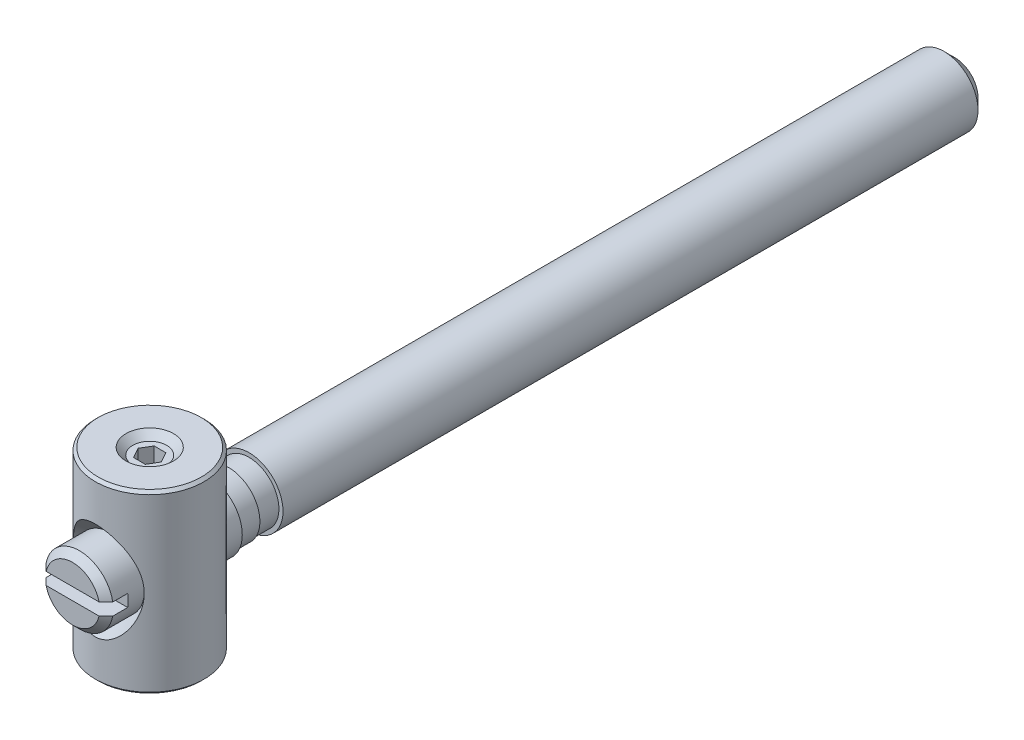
ISO-10303-21;
HEADER;
FILE_DESCRIPTION(('STEP AP214'),'2;1');
FILE_NAME('part.step','',(''),(''),'','','');
FILE_SCHEMA(('AUTOMOTIVE_DESIGN { 1 0 10303 214 1 1 1 1 }'));
ENDSEC;
DATA;
#1=APPLICATION_CONTEXT('core data for automotive mechanical design processes');
#2=APPLICATION_PROTOCOL_DEFINITION('international standard','automotive_design',2000,#1);
#3=PRODUCT_CONTEXT('',#1,'mechanical');
#4=PRODUCT('Part','Part','',(#3));
#5=PRODUCT_RELATED_PRODUCT_CATEGORY('part','',(#4));
#6=PRODUCT_DEFINITION_FORMATION('','',#4);
#7=PRODUCT_DEFINITION_CONTEXT('part definition',#1,'design');
#8=PRODUCT_DEFINITION('design','',#6,#7);
#9=PRODUCT_DEFINITION_SHAPE('','',#8);
#10=(LENGTH_UNIT() NAMED_UNIT(*) SI_UNIT(.MILLI.,.METRE.));
#11=(NAMED_UNIT(*) PLANE_ANGLE_UNIT() SI_UNIT($,.RADIAN.));
#12=(NAMED_UNIT(*) SI_UNIT($,.STERADIAN.) SOLID_ANGLE_UNIT());
#13=UNCERTAINTY_MEASURE_WITH_UNIT(LENGTH_MEASURE(1.E-05),#10,'distance_accuracy_value','');
#14=(GEOMETRIC_REPRESENTATION_CONTEXT(3) GLOBAL_UNCERTAINTY_ASSIGNED_CONTEXT((#13)) GLOBAL_UNIT_ASSIGNED_CONTEXT((#10,
#11,#12)) REPRESENTATION_CONTEXT('',''));
#15=CARTESIAN_POINT('',(0.,0.,0.));
#16=DIRECTION('',(0.,0.,1.));
#17=DIRECTION('',(1.,0.,0.));
#18=AXIS2_PLACEMENT_3D('',#15,#16,#17);
#19=CARTESIAN_POINT('',(0.,0.,5.682));
#20=DIRECTION('',(0.,0.,-1.));
#21=DIRECTION('',(-1.,0.,0.));
#22=AXIS2_PLACEMENT_3D('',#19,#20,#21);
#23=PLANE('',#22);
#24=CARTESIAN_POINT('',(0.,0.,5.682));
#25=DIRECTION('',(0.,0.,-1.));
#26=DIRECTION('',(-1.,0.,0.));
#27=AXIS2_PLACEMENT_3D('',#24,#25,#26);
#28=CIRCLE('',#27,2.);
#29=CARTESIAN_POINT('',(1.94871752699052,0.449999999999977,5.682));
#30=VERTEX_POINT('',#29);
#31=CARTESIAN_POINT('',(-1.94871752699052,0.449999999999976,5.682));
#32=VERTEX_POINT('',#31);
#33=EDGE_CURVE('E300',#30,#32,#28,.F.);
#34=ORIENTED_EDGE('',*,*,#33,.T.);
#35=DIRECTION('',(-1.,0.,0.));
#36=VECTOR('',#35,1.);
#37=CARTESIAN_POINT('',(-2.45916652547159,0.449999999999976,5.682));
#38=LINE('',#37,#36);
#39=EDGE_CURVE('E33',#30,#32,#38,.T.);
#40=ORIENTED_EDGE('',*,*,#39,.F.);
#41=EDGE_LOOP('',(#34,#40));
#42=FACE_BOUND('',#41,.T.);
#43=ADVANCED_FACE('F14',(#42),#23,.F.);
#44=CARTESIAN_POINT('',(-1.94871752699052,-0.450000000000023,5.682));
#45=VERTEX_POINT('',#44);
#46=CARTESIAN_POINT('',(1.94871752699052,-0.450000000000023,5.682));
#47=VERTEX_POINT('',#46);
#48=EDGE_CURVE('E297',#45,#47,#28,.F.);
#49=ORIENTED_EDGE('',*,*,#48,.T.);
#50=DIRECTION('',(1.,0.,0.));
#51=VECTOR('',#50,1.);
#52=CARTESIAN_POINT('',(-2.45916652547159,-0.450000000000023,5.682));
#53=LINE('',#52,#51);
#54=EDGE_CURVE('E332',#45,#47,#53,.T.);
#55=ORIENTED_EDGE('',*,*,#54,.F.);
#56=EDGE_LOOP('',(#49,#55));
#57=FACE_BOUND('',#56,.T.);
#58=ADVANCED_FACE('F249',(#57),#23,.F.);
#59=CARTESIAN_POINT('',(0.,0.,5.682));
#60=DIRECTION('',(0.,0.,-1.));
#61=DIRECTION('',(-1.,0.,0.));
#62=AXIS2_PLACEMENT_3D('',#59,#60,#61);
#63=CONICAL_SURFACE('',#62,2.,0.785398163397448);
#64=CARTESIAN_POINT('',(5.42557622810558,0.449999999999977,2.23779414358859));
#65=CARTESIAN_POINT('',(5.23197486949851,0.449999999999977,2.43072707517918));
#66=CARTESIAN_POINT('',(5.03834381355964,0.449999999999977,2.62363024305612));
#67=CARTESIAN_POINT('',(4.6509706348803,0.449999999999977,3.00934645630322));
#68=CARTESIAN_POINT('',(4.4572285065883,0.449999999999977,3.2021594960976));
#69=CARTESIAN_POINT('',(4.06948715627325,0.449999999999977,3.58775862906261));
#70=CARTESIAN_POINT('',(3.87548784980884,0.449999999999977,3.78054463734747));
#71=CARTESIAN_POINT('',(3.48727998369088,0.449999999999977,4.16588499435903));
#72=CARTESIAN_POINT('',(3.29307143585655,0.449999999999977,4.35843935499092));
#73=CARTESIAN_POINT('',(2.91518099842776,0.449999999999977,4.73241170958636));
#74=CARTESIAN_POINT('',(2.73151868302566,0.449999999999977,4.91384946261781));
#75=CARTESIAN_POINT('',(2.45557699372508,0.449999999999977,5.18558092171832));
#76=CARTESIAN_POINT('',(2.36351424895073,0.449999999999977,5.27609453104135));
#77=CARTESIAN_POINT('',(2.1791844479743,0.449999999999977,5.45691081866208));
#78=CARTESIAN_POINT('',(2.08691739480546,0.449999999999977,5.54721350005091));
#79=CARTESIAN_POINT('',(1.90209588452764,0.449999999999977,5.72750454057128));
#80=CARTESIAN_POINT('',(1.80954145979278,0.449999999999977,5.81749293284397));
#81=CARTESIAN_POINT('',(1.62396889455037,0.449999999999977,5.9970009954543));
#82=CARTESIAN_POINT('',(1.53095072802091,0.449999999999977,6.08652063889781));
#83=CARTESIAN_POINT('',(1.34419825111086,0.449999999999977,6.26475938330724));
#84=CARTESIAN_POINT('',(1.25046415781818,0.449999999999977,6.35347871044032));
#85=CARTESIAN_POINT('',(1.10883677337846,0.449999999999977,6.48544905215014));
#86=CARTESIAN_POINT('',(1.06145881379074,0.449999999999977,6.52925239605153));
#87=CARTESIAN_POINT('',(0.966208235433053,0.449999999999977,6.61631715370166));
#88=CARTESIAN_POINT('',(0.918335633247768,0.449999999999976,6.65957858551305));
#89=CARTESIAN_POINT('',(0.843045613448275,0.449999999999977,6.72645124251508));
#90=CARTESIAN_POINT('',(0.815880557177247,0.449999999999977,6.75034631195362));
#91=CARTESIAN_POINT('',(0.761250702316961,0.449999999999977,6.79779493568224));
#92=CARTESIAN_POINT('',(0.733785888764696,0.449999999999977,6.82134847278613));
#93=CARTESIAN_POINT('',(0.678493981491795,0.449999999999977,6.86797710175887));
#94=CARTESIAN_POINT('',(0.650667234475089,0.449999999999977,6.89105260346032));
#95=CARTESIAN_POINT('',(0.594503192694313,0.449999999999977,6.93657198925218));
#96=CARTESIAN_POINT('',(0.566165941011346,0.449999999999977,6.95901592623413));
#97=CARTESIAN_POINT('',(0.508352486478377,0.449999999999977,7.00334584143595));
#98=CARTESIAN_POINT('',(0.478865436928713,0.449999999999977,7.02521777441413));
#99=CARTESIAN_POINT('',(0.418849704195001,0.449999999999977,7.06760463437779));
#100=CARTESIAN_POINT('',(0.388319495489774,0.449999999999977,7.08811743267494));
#101=CARTESIAN_POINT('',(0.32616938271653,0.449999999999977,7.12675491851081));
#102=CARTESIAN_POINT('',(0.294562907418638,0.449999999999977,7.14490082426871));
#103=CARTESIAN_POINT('',(0.229579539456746,0.449999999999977,7.17759771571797));
#104=CARTESIAN_POINT('',(0.196208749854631,0.449999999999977,7.19216022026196));
#105=CARTESIAN_POINT('',(0.135363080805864,0.449999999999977,7.21273567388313));
#106=CARTESIAN_POINT('',(0.108310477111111,0.449999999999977,7.2199471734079));
#107=CARTESIAN_POINT('',(0.0534100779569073,0.449999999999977,7.22963853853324));
#108=CARTESIAN_POINT('',(0.0255652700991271,0.449999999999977,7.23213427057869));
#109=CARTESIAN_POINT('',(-0.0301828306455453,0.449999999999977,7.23185388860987));
#110=CARTESIAN_POINT('',(-0.0580860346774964,0.449999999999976,7.22906128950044));
#111=CARTESIAN_POINT('',(-0.113057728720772,0.449999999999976,7.21881091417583));
#112=CARTESIAN_POINT('',(-0.140123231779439,0.449999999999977,7.21133809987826));
#113=CARTESIAN_POINT('',(-0.195788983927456,0.449999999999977,7.19202171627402));
#114=CARTESIAN_POINT('',(-0.22425323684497,0.449999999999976,7.17980245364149));
#115=CARTESIAN_POINT('',(-0.279866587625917,0.449999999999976,7.15262748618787));
#116=CARTESIAN_POINT('',(-0.307012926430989,0.449999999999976,7.1376663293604));
#117=CARTESIAN_POINT('',(-0.360452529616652,0.449999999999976,7.10583819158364));
#118=CARTESIAN_POINT('',(-0.386736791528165,0.449999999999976,7.08895635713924));
#119=CARTESIAN_POINT('',(-0.438454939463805,0.449999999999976,7.05400253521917));
#120=CARTESIAN_POINT('',(-0.46388961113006,0.449999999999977,7.03593169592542));
#121=CARTESIAN_POINT('',(-0.516620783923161,0.449999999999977,6.99712961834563));
#122=CARTESIAN_POINT('',(-0.543853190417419,0.449999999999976,6.97631186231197));
#123=CARTESIAN_POINT('',(-0.597765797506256,0.449999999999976,6.93397086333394));
#124=CARTESIAN_POINT('',(-0.624445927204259,0.449999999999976,6.91244753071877));
#125=CARTESIAN_POINT('',(-0.703891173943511,0.449999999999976,6.84710798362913));
#126=CARTESIAN_POINT('',(-0.756036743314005,0.449999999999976,6.80254079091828));
#127=CARTESIAN_POINT('',(-0.859426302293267,0.449999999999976,6.71221047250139));
#128=CARTESIAN_POINT('',(-0.910668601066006,0.449999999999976,6.66644543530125));
#129=CARTESIAN_POINT('',(-1.01249538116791,0.449999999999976,6.57421763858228));
#130=CARTESIAN_POINT('',(-1.06308003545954,0.449999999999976,6.52775506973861));
#131=CARTESIAN_POINT('',(-1.16360564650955,0.449999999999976,6.43455196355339));
#132=CARTESIAN_POINT('',(-1.21354839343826,0.449999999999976,6.38781335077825));
#133=CARTESIAN_POINT('',(-1.31312844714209,0.449999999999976,6.29400547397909));
#134=CARTESIAN_POINT('',(-1.3627657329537,0.449999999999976,6.2469361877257));
#135=CARTESIAN_POINT('',(-1.51124171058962,0.449999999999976,6.10547191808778));
#136=CARTESIAN_POINT('',(-1.60974566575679,0.449999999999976,6.01072596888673));
#137=CARTESIAN_POINT('',(-1.8645669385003,0.449999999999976,5.76431536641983));
#138=CARTESIAN_POINT('',(-2.02049383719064,0.449999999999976,5.6122480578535));
#139=CARTESIAN_POINT('',(-2.33171348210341,0.449999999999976,5.30746251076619));
#140=CARTESIAN_POINT('',(-2.4870062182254,0.449999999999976,5.15474426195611));
#141=CARTESIAN_POINT('',(-2.79729282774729,0.449999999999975,4.84886243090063));
#142=CARTESIAN_POINT('',(-2.95228653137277,0.449999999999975,4.69569867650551));
#143=CARTESIAN_POINT('',(-3.26204211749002,0.449999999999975,4.38913891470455));
#144=CARTESIAN_POINT('',(-3.41680400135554,0.449999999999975,4.23574290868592));
#145=CARTESIAN_POINT('',(-3.88099551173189,0.449999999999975,3.77519807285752));
#146=CARTESIAN_POINT('',(-4.19019976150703,0.449999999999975,3.46782212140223));
#147=CARTESIAN_POINT('',(-4.65370644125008,0.449999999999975,3.0066106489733));
#148=CARTESIAN_POINT('',(-4.80812040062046,0.449999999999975,2.85288710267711));
#149=CARTESIAN_POINT('',(-5.11688894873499,0.449999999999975,2.54538108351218));
#150=CARTESIAN_POINT('',(-5.271243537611,0.449999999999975,2.39159861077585));
#151=CARTESIAN_POINT('',(-5.42557622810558,0.449999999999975,2.23779414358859));
#152=B_SPLINE_CURVE_WITH_KNOTS('',3,(#64,#65,#66,#67,#68,#69,#70,#71,#72,#73,#74,#75,#76,#77,
#78,#79,#80,#81,#82,#83,#84,#85,#86,#87,#88,#89,#90,#91,#92,#93,#94,#95,#96,#97,#98,#99,#100,
#101,#102,#103,#104,#105,#106,#107,#108,#109,#110,#111,#112,#113,#114,#115,#116,#117,#118,#119,
#120,#121,#122,#123,#124,#125,#126,#127,#128,#129,#130,#131,#132,#133,#134,#135,#136,#137,#138,
#139,#140,#141,#142,#143,#144,#145,#146,#147,#148,#149,#150,#151),.UNSPECIFIED.,.F.,.F.,(4,2,2,
2,2,2,2,2,2,2,2,2,2,2,2,2,2,2,2,2,2,2,2,2,2,2,2,2,2,2,2,2,2,2,2,2,2,2,2,2,2,2,2,4),(0.,
0.819964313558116,1.63997398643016,2.46047345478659,3.28092878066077,4.05543648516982,
4.44275311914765,4.83006404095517,5.21733280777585,5.60462355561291,5.99180119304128,
6.18537215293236,6.37893664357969,6.48747135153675,6.59601150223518,6.70445438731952,
6.81288816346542,6.92300307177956,7.03328655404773,7.14250119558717,7.25136004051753,
7.33503215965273,7.41842225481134,7.50207272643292,7.58599336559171,7.67870028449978,
7.77159358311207,7.86526158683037,7.95884042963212,8.06165788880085,8.1644884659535,
8.37024155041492,8.57634583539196,8.78239477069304,8.98759769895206,9.192814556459,
9.60283291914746,10.2562345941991,10.9096466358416,11.5633584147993,12.2170663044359,
13.5250356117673,14.1786956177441,14.8323541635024),.UNSPECIFIED.);
#153=CARTESIAN_POINT('',(2.4591665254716,0.449999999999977,5.182));
#154=VERTEX_POINT('',#153);
#155=EDGE_CURVE('E224',#154,#30,#152,.T.);
#156=ORIENTED_EDGE('',*,*,#155,.F.);
#157=CARTESIAN_POINT('',(0.,0.,5.182));
#158=DIRECTION('',(0.,0.,-1.));
#159=DIRECTION('',(-1.,0.,0.));
#160=AXIS2_PLACEMENT_3D('',#157,#158,#159);
#161=CIRCLE('',#160,2.5);
#162=CARTESIAN_POINT('',(-2.45916652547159,0.449999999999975,5.182));
#163=VERTEX_POINT('',#162);
#164=EDGE_CURVE('E291',#163,#154,#161,.T.);
#165=ORIENTED_EDGE('',*,*,#164,.F.);
#166=EDGE_CURVE('E225',#32,#163,#152,.T.);
#167=ORIENTED_EDGE('',*,*,#166,.F.);
#168=ORIENTED_EDGE('',*,*,#33,.F.);
#169=EDGE_LOOP('',(#156,#165,#167,#168));
#170=FACE_BOUND('',#169,.T.);
#171=ADVANCED_FACE('F232',(#170),#63,.T.);
#172=CARTESIAN_POINT('',(-2.45916652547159,0.449999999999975,4.082));
#173=DIRECTION('',(0.,1.,0.));
#174=DIRECTION('',(-1.,0.,0.));
#175=AXIS2_PLACEMENT_3D('',#172,#173,#174);
#176=PLANE('',#175);
#177=ORIENTED_EDGE('',*,*,#155,.T.);
#178=ORIENTED_EDGE('',*,*,#39,.T.);
#179=ORIENTED_EDGE('',*,*,#166,.T.);
#180=DIRECTION('',(0.,0.,1.));
#181=VECTOR('',#180,1.);
#182=CARTESIAN_POINT('',(-2.45916652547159,0.449999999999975,4.082));
#183=LINE('',#182,#181);
#184=CARTESIAN_POINT('',(-2.45916652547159,0.449999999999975,4.082));
#185=VERTEX_POINT('',#184);
#186=EDGE_CURVE('E323',#185,#163,#183,.T.);
#187=ORIENTED_EDGE('',*,*,#186,.F.);
#188=DIRECTION('',(-1.,0.,0.));
#189=VECTOR('',#188,1.);
#190=CARTESIAN_POINT('',(-2.45916652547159,0.449999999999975,4.082));
#191=LINE('',#190,#189);
#192=CARTESIAN_POINT('',(2.4591665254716,0.449999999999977,4.082));
#193=VERTEX_POINT('',#192);
#194=EDGE_CURVE('E342',#193,#185,#191,.T.);
#195=ORIENTED_EDGE('',*,*,#194,.F.);
#196=DIRECTION('',(0.,0.,1.));
#197=VECTOR('',#196,1.);
#198=CARTESIAN_POINT('',(2.4591665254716,0.449999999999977,4.082));
#199=LINE('',#198,#197);
#200=EDGE_CURVE('E320',#193,#154,#199,.T.);
#201=ORIENTED_EDGE('',*,*,#200,.T.);
#202=EDGE_LOOP('',(#177,#178,#179,#187,#195,#201));
#203=FACE_BOUND('',#202,.T.);
#204=ADVANCED_FACE('F243',(#203),#176,.F.);
#205=CARTESIAN_POINT('',(0.,0.,4.082));
#206=DIRECTION('',(0.,0.,1.));
#207=DIRECTION('',(1.,0.,0.));
#208=AXIS2_PLACEMENT_3D('',#205,#206,#207);
#209=PLANE('',#208);
#210=CARTESIAN_POINT('',(0.,0.,4.082));
#211=DIRECTION('',(0.,0.,1.));
#212=DIRECTION('',(1.,0.,0.));
#213=AXIS2_PLACEMENT_3D('',#210,#211,#212);
#214=CIRCLE('',#213,2.5);
#215=CARTESIAN_POINT('',(2.4591665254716,-0.450000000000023,4.082));
#216=VERTEX_POINT('',#215);
#217=EDGE_CURVE('E335',#216,#193,#214,.T.);
#218=ORIENTED_EDGE('',*,*,#217,.T.);
#219=ORIENTED_EDGE('',*,*,#194,.T.);
#220=CARTESIAN_POINT('',(0.,0.,4.082));
#221=DIRECTION('',(0.,0.,1.));
#222=DIRECTION('',(1.,0.,0.));
#223=AXIS2_PLACEMENT_3D('',#220,#221,#222);
#224=CIRCLE('',#223,2.5);
#225=CARTESIAN_POINT('',(-2.45916652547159,-0.450000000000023,4.082));
#226=VERTEX_POINT('',#225);
#227=EDGE_CURVE('E339',#185,#226,#224,.T.);
#228=ORIENTED_EDGE('',*,*,#227,.T.);
#229=DIRECTION('',(1.,0.,0.));
#230=VECTOR('',#229,1.);
#231=CARTESIAN_POINT('',(-2.45916652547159,-0.450000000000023,4.082));
#232=LINE('',#231,#230);
#233=EDGE_CURVE('E324',#226,#216,#232,.T.);
#234=ORIENTED_EDGE('',*,*,#233,.T.);
#235=EDGE_LOOP('',(#218,#219,#228,#234));
#236=FACE_BOUND('',#235,.T.);
#237=ADVANCED_FACE('F241',(#236),#209,.T.);
#238=CARTESIAN_POINT('',(-2.45916652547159,-0.450000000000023,4.082));
#239=DIRECTION('',(0.,-1.,0.));
#240=DIRECTION('',(1.,0.,0.));
#241=AXIS2_PLACEMENT_3D('',#238,#239,#240);
#242=PLANE('',#241);
#243=CARTESIAN_POINT('',(-5.42557622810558,-0.450000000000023,2.23779414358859));
#244=CARTESIAN_POINT('',(-5.23197486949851,-0.450000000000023,2.43072707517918));
#245=CARTESIAN_POINT('',(-5.03834381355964,-0.450000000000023,2.62363024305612));
#246=CARTESIAN_POINT('',(-4.65097063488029,-0.450000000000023,3.00934645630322));
#247=CARTESIAN_POINT('',(-4.4572285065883,-0.450000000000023,3.20215949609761));
#248=CARTESIAN_POINT('',(-4.06948715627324,-0.450000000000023,3.58775862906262));
#249=CARTESIAN_POINT('',(-3.87548784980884,-0.450000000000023,3.78054463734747));
#250=CARTESIAN_POINT('',(-3.48727998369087,-0.450000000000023,4.16588499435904));
#251=CARTESIAN_POINT('',(-3.29307143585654,-0.450000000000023,4.35843935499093));
#252=CARTESIAN_POINT('',(-2.91518099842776,-0.450000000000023,4.73241170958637));
#253=CARTESIAN_POINT('',(-2.73151868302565,-0.450000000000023,4.91384946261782));
#254=CARTESIAN_POINT('',(-2.45557699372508,-0.450000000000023,5.18558092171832));
#255=CARTESIAN_POINT('',(-2.36351424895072,-0.450000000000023,5.27609453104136));
#256=CARTESIAN_POINT('',(-2.1791844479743,-0.450000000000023,5.45691081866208));
#257=CARTESIAN_POINT('',(-2.08691739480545,-0.450000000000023,5.54721350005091));
#258=CARTESIAN_POINT('',(-1.90209588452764,-0.450000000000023,5.72750454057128));
#259=CARTESIAN_POINT('',(-1.80954145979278,-0.450000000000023,5.81749293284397));
#260=CARTESIAN_POINT('',(-1.62396889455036,-0.450000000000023,5.9970009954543));
#261=CARTESIAN_POINT('',(-1.5309507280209,-0.450000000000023,6.08652063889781));
#262=CARTESIAN_POINT('',(-1.34419825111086,-0.450000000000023,6.26475938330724));
#263=CARTESIAN_POINT('',(-1.25046415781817,-0.450000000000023,6.35347871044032));
#264=CARTESIAN_POINT('',(-1.10883677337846,-0.450000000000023,6.48544905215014));
#265=CARTESIAN_POINT('',(-1.06145881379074,-0.450000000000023,6.52925239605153));
#266=CARTESIAN_POINT('',(-0.96620823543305,-0.450000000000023,6.61631715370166));
#267=CARTESIAN_POINT('',(-0.918335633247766,-0.450000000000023,6.65957858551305));
#268=CARTESIAN_POINT('',(-0.843045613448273,-0.450000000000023,6.72645124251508));
#269=CARTESIAN_POINT('',(-0.815880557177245,-0.450000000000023,6.75034631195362));
#270=CARTESIAN_POINT('',(-0.761250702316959,-0.450000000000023,6.79779493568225));
#271=CARTESIAN_POINT('',(-0.733785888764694,-0.450000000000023,6.82134847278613));
#272=CARTESIAN_POINT('',(-0.678493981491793,-0.450000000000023,6.86797710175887));
#273=CARTESIAN_POINT('',(-0.650667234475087,-0.450000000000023,6.89105260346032));
#274=CARTESIAN_POINT('',(-0.594503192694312,-0.450000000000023,6.93657198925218));
#275=CARTESIAN_POINT('',(-0.566165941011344,-0.450000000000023,6.95901592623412));
#276=CARTESIAN_POINT('',(-0.508352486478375,-0.450000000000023,7.00334584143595));
#277=CARTESIAN_POINT('',(-0.478865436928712,-0.450000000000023,7.02521777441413));
#278=CARTESIAN_POINT('',(-0.418849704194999,-0.450000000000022,7.06760463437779));
#279=CARTESIAN_POINT('',(-0.388319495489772,-0.450000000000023,7.08811743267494));
#280=CARTESIAN_POINT('',(-0.326169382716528,-0.450000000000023,7.12675491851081));
#281=CARTESIAN_POINT('',(-0.294562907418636,-0.450000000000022,7.14490082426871));
#282=CARTESIAN_POINT('',(-0.229579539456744,-0.450000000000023,7.17759771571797));
#283=CARTESIAN_POINT('',(-0.196208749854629,-0.450000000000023,7.19216022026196));
#284=CARTESIAN_POINT('',(-0.135363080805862,-0.450000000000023,7.21273567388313));
#285=CARTESIAN_POINT('',(-0.10831047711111,-0.450000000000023,7.2199471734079));
#286=CARTESIAN_POINT('',(-0.0534100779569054,-0.450000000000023,7.22963853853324));
#287=CARTESIAN_POINT('',(-0.0255652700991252,-0.450000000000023,7.23213427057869));
#288=CARTESIAN_POINT('',(0.0301828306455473,-0.450000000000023,7.23185388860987));
#289=CARTESIAN_POINT('',(0.0580860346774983,-0.450000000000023,7.22906128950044));
#290=CARTESIAN_POINT('',(0.113057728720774,-0.450000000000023,7.21881091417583));
#291=CARTESIAN_POINT('',(0.140123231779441,-0.450000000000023,7.21133809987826));
#292=CARTESIAN_POINT('',(0.195788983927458,-0.450000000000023,7.19202171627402));
#293=CARTESIAN_POINT('',(0.224253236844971,-0.450000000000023,7.17980245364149));
#294=CARTESIAN_POINT('',(0.279866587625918,-0.450000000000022,7.15262748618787));
#295=CARTESIAN_POINT('',(0.307012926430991,-0.450000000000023,7.1376663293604));
#296=CARTESIAN_POINT('',(0.360452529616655,-0.450000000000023,7.10583819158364));
#297=CARTESIAN_POINT('',(0.386736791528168,-0.450000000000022,7.08895635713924));
#298=CARTESIAN_POINT('',(0.438454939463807,-0.450000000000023,7.05400253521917));
#299=CARTESIAN_POINT('',(0.463889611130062,-0.450000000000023,7.03593169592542));
#300=CARTESIAN_POINT('',(0.516620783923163,-0.450000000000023,6.99712961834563));
#301=CARTESIAN_POINT('',(0.543853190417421,-0.450000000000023,6.97631186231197));
#302=CARTESIAN_POINT('',(0.597765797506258,-0.450000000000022,6.93397086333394));
#303=CARTESIAN_POINT('',(0.62444592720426,-0.450000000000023,6.91244753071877));
#304=CARTESIAN_POINT('',(0.703891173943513,-0.450000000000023,6.84710798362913));
#305=CARTESIAN_POINT('',(0.756036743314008,-0.450000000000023,6.80254079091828));
#306=CARTESIAN_POINT('',(0.859426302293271,-0.450000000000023,6.71221047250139));
#307=CARTESIAN_POINT('',(0.910668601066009,-0.450000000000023,6.66644543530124));
#308=CARTESIAN_POINT('',(1.01249538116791,-0.450000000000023,6.57421763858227));
#309=CARTESIAN_POINT('',(1.06308003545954,-0.450000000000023,6.52775506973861));
#310=CARTESIAN_POINT('',(1.16360564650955,-0.450000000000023,6.43455196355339));
#311=CARTESIAN_POINT('',(1.21354839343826,-0.450000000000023,6.38781335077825));
#312=CARTESIAN_POINT('',(1.3131284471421,-0.450000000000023,6.29400547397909));
#313=CARTESIAN_POINT('',(1.3627657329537,-0.450000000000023,6.2469361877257));
#314=CARTESIAN_POINT('',(1.51124171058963,-0.450000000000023,6.10547191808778));
#315=CARTESIAN_POINT('',(1.6097456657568,-0.450000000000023,6.01072596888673));
#316=CARTESIAN_POINT('',(1.8645669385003,-0.450000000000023,5.76431536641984));
#317=CARTESIAN_POINT('',(2.02049383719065,-0.450000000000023,5.6122480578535));
#318=CARTESIAN_POINT('',(2.33171348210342,-0.450000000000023,5.30746251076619));
#319=CARTESIAN_POINT('',(2.4870062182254,-0.450000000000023,5.15474426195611));
#320=CARTESIAN_POINT('',(2.79729282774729,-0.450000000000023,4.84886243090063));
#321=CARTESIAN_POINT('',(2.95228653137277,-0.450000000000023,4.69569867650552));
#322=CARTESIAN_POINT('',(3.26204211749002,-0.450000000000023,4.38913891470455));
#323=CARTESIAN_POINT('',(3.41680400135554,-0.450000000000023,4.23574290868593));
#324=CARTESIAN_POINT('',(3.88099551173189,-0.450000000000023,3.77519807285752));
#325=CARTESIAN_POINT('',(4.19019976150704,-0.450000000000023,3.46782212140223));
#326=CARTESIAN_POINT('',(4.65370644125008,-0.450000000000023,3.0066106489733));
#327=CARTESIAN_POINT('',(4.80812040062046,-0.450000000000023,2.85288710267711));
#328=CARTESIAN_POINT('',(5.11688894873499,-0.450000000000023,2.54538108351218));
#329=CARTESIAN_POINT('',(5.271243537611,-0.450000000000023,2.39159861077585));
#330=CARTESIAN_POINT('',(5.42557622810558,-0.450000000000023,2.23779414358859));
#331=B_SPLINE_CURVE_WITH_KNOTS('',3,(#243,#244,#245,#246,#247,#248,#249,#250,#251,#252,#253,
#254,#255,#256,#257,#258,#259,#260,#261,#262,#263,#264,#265,#266,#267,#268,#269,#270,#271,#272,
#273,#274,#275,#276,#277,#278,#279,#280,#281,#282,#283,#284,#285,#286,#287,#288,#289,#290,#291,
#292,#293,#294,#295,#296,#297,#298,#299,#300,#301,#302,#303,#304,#305,#306,#307,#308,#309,#310,
#311,#312,#313,#314,#315,#316,#317,#318,#319,#320,#321,#322,#323,#324,#325,#326,#327,#328,#329,
#330),.UNSPECIFIED.,.F.,.F.,(4,2,2,2,2,2,2,2,2,2,2,2,2,2,2,2,2,2,2,2,2,2,2,2,2,2,2,2,2,2,2,2,2,
2,2,2,2,2,2,2,2,2,2,4),(0.,0.81996431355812,1.63997398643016,2.4604734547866,3.28092878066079,
4.05543648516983,4.44275311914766,4.83006404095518,5.21733280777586,5.60462355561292,
5.99180119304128,6.18537215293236,6.37893664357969,6.48747135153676,6.59601150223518,
6.70445438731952,6.81288816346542,6.92300307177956,7.03328655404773,7.14250119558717,
7.25136004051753,7.33503215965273,7.41842225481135,7.50207272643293,7.58599336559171,
7.67870028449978,7.77159358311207,7.86526158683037,7.95884042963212,8.06165788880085,
8.1644884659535,8.37024155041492,8.57634583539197,8.78239477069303,8.98759769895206,
9.192814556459,9.60283291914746,10.2562345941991,10.9096466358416,11.5633584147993,
12.2170663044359,13.5250356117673,14.1786956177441,14.8323541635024),.UNSPECIFIED.);
#332=CARTESIAN_POINT('',(-2.45916652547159,-0.450000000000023,5.182));
#333=VERTEX_POINT('',#332);
#334=EDGE_CURVE('E215',#333,#45,#331,.T.);
#335=ORIENTED_EDGE('',*,*,#334,.T.);
#336=ORIENTED_EDGE('',*,*,#54,.T.);
#337=CARTESIAN_POINT('',(2.4591665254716,-0.450000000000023,5.182));
#338=VERTEX_POINT('',#337);
#339=EDGE_CURVE('E216',#47,#338,#331,.T.);
#340=ORIENTED_EDGE('',*,*,#339,.T.);
#341=DIRECTION('',(0.,0.,1.));
#342=VECTOR('',#341,1.);
#343=CARTESIAN_POINT('',(2.4591665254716,-0.450000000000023,4.082));
#344=LINE('',#343,#342);
#345=EDGE_CURVE('E319',#216,#338,#344,.T.);
#346=ORIENTED_EDGE('',*,*,#345,.F.);
#347=ORIENTED_EDGE('',*,*,#233,.F.);
#348=DIRECTION('',(0.,0.,1.));
#349=VECTOR('',#348,1.);
#350=CARTESIAN_POINT('',(-2.45916652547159,-0.450000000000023,4.082));
#351=LINE('',#350,#349);
#352=EDGE_CURVE('E327',#226,#333,#351,.T.);
#353=ORIENTED_EDGE('',*,*,#352,.T.);
#354=EDGE_LOOP('',(#335,#336,#340,#346,#347,#353));
#355=FACE_BOUND('',#354,.T.);
#356=ADVANCED_FACE('F236',(#355),#242,.F.);
#357=ORIENTED_EDGE('',*,*,#334,.F.);
#358=EDGE_CURVE('E296',#338,#333,#161,.T.);
#359=ORIENTED_EDGE('',*,*,#358,.F.);
#360=ORIENTED_EDGE('',*,*,#339,.F.);
#361=ORIENTED_EDGE('',*,*,#48,.F.);
#362=EDGE_LOOP('',(#357,#359,#360,#361));
#363=FACE_BOUND('',#362,.T.);
#364=ADVANCED_FACE('F240',(#363),#63,.T.);
#365=CARTESIAN_POINT('',(0.,0.,35.977365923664));
#366=DIRECTION('',(0.,0.,1.));
#367=DIRECTION('',(1.,0.,0.));
#368=AXIS2_PLACEMENT_3D('',#365,#366,#367);
#369=CYLINDRICAL_SURFACE('',#368,2.5);
#370=ORIENTED_EDGE('',*,*,#358,.T.);
#371=ORIENTED_EDGE('',*,*,#352,.F.);
#372=ORIENTED_EDGE('',*,*,#227,.F.);
#373=ORIENTED_EDGE('',*,*,#186,.T.);
#374=ORIENTED_EDGE('',*,*,#164,.T.);
#375=ORIENTED_EDGE('',*,*,#200,.F.);
#376=ORIENTED_EDGE('',*,*,#217,.F.);
#377=ORIENTED_EDGE('',*,*,#345,.T.);
#378=EDGE_LOOP('',(#370,#371,#372,#373,#374,#375,#376,#377));
#379=FACE_BOUND('',#378,.T.);
#380=CARTESIAN_POINT('',(0.,0.,2.9));
#381=DIRECTION('',(0.,0.,1.));
#382=DIRECTION('',(0.,1.,0.));
#383=AXIS2_PLACEMENT_3D('',#380,#381,#382);
#384=CIRCLE('',#383,2.5);
#385=CARTESIAN_POINT('',(0.,2.5,2.9));
#386=VERTEX_POINT('',#385);
#387=EDGE_CURVE('E24',#386,#386,#384,.F.);
#388=ORIENTED_EDGE('',*,*,#387,.F.);
#389=EDGE_LOOP('',(#388));
#390=FACE_BOUND('',#389,.T.);
#391=ADVANCED_FACE('F255',(#379,#390),#369,.T.);
#392=CARTESIAN_POINT('',(0.,0.,-4.318));
#393=DIRECTION('',(0.,0.,1.));
#394=DIRECTION('',(1.,0.,0.));
#395=AXIS2_PLACEMENT_3D('',#392,#393,#394);
#396=CIRCLE('',#395,2.5);
#397=CARTESIAN_POINT('',(2.5,0.,-4.318));
#398=VERTEX_POINT('',#397);
#399=EDGE_CURVE('E316',#398,#398,#396,.T.);
#400=ORIENTED_EDGE('',*,*,#399,.T.);
#401=EDGE_LOOP('',(#400));
#402=FACE_BOUND('',#401,.T.);
#403=CARTESIAN_POINT('',(0.,0.,-2.9));
#404=DIRECTION('',(0.,0.,-1.));
#405=DIRECTION('',(0.,-1.,0.));
#406=AXIS2_PLACEMENT_3D('',#403,#404,#405);
#407=CIRCLE('',#406,2.5);
#408=CARTESIAN_POINT('',(0.,-2.5,-2.9));
#409=VERTEX_POINT('',#408);
#410=EDGE_CURVE('E9',#409,#409,#407,.F.);
#411=ORIENTED_EDGE('',*,*,#410,.F.);
#412=EDGE_LOOP('',(#411));
#413=FACE_BOUND('',#412,.T.);
#414=ADVANCED_FACE('F251',(#402,#413),#369,.T.);
#415=CARTESIAN_POINT('',(0.,0.,-59.318));
#416=DIRECTION('',(0.,0.,1.));
#417=DIRECTION('',(1.,0.,0.));
#418=AXIS2_PLACEMENT_3D('',#415,#416,#417);
#419=PLANE('',#418);
#420=CARTESIAN_POINT('',(0.,0.,-59.318));
#421=DIRECTION('',(0.,0.,1.));
#422=DIRECTION('',(1.,0.,0.));
#423=AXIS2_PLACEMENT_3D('',#420,#421,#422);
#424=CIRCLE('',#423,1.7);
#425=CARTESIAN_POINT('',(1.69999999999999,0.,-59.318));
#426=VERTEX_POINT('',#425);
#427=EDGE_CURVE('E287',#426,#426,#424,.F.);
#428=ORIENTED_EDGE('',*,*,#427,.T.);
#429=EDGE_LOOP('',(#428));
#430=FACE_BOUND('',#429,.T.);
#431=ADVANCED_FACE('F254',(#430),#419,.F.);
#432=CARTESIAN_POINT('',(0.,0.,35.977365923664));
#433=DIRECTION('',(0.,0.,1.));
#434=DIRECTION('',(1.,0.,0.));
#435=AXIS2_PLACEMENT_3D('',#432,#433,#434);
#436=CYLINDRICAL_SURFACE('',#435,2.5);
#437=CARTESIAN_POINT('',(0.,0.,-58.518));
#438=DIRECTION('',(0.,0.,1.));
#439=DIRECTION('',(1.,0.,0.));
#440=AXIS2_PLACEMENT_3D('',#437,#438,#439);
#441=CIRCLE('',#440,2.5);
#442=CARTESIAN_POINT('',(2.49999999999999,0.,-58.518));
#443=VERTEX_POINT('',#442);
#444=EDGE_CURVE('E289',#443,#443,#441,.T.);
#445=ORIENTED_EDGE('',*,*,#444,.T.);
#446=EDGE_LOOP('',(#445));
#447=FACE_BOUND('',#446,.T.);
#448=CARTESIAN_POINT('',(0.,0.,-7.318));
#449=DIRECTION('',(0.,0.,1.));
#450=DIRECTION('',(1.,0.,0.));
#451=AXIS2_PLACEMENT_3D('',#448,#449,#450);
#452=CIRCLE('',#451,2.5);
#453=CARTESIAN_POINT('',(2.5,0.,-7.318));
#454=VERTEX_POINT('',#453);
#455=EDGE_CURVE('E301',#454,#454,#452,.T.);
#456=ORIENTED_EDGE('',*,*,#455,.F.);
#457=EDGE_LOOP('',(#456));
#458=FACE_BOUND('',#457,.T.);
#459=ADVANCED_FACE('F276',(#447,#458),#436,.T.);
#460=CARTESIAN_POINT('',(0.,2.2,-7.318));
#461=DIRECTION('',(0.,0.,-1.));
#462=DIRECTION('',(-1.,0.,0.));
#463=AXIS2_PLACEMENT_3D('',#460,#461,#462);
#464=PLANE('',#463);
#465=CARTESIAN_POINT('',(0.,0.,-7.318));
#466=DIRECTION('',(0.,0.,1.));
#467=DIRECTION('',(1.,0.,0.));
#468=AXIS2_PLACEMENT_3D('',#465,#466,#467);
#469=CIRCLE('',#468,2.2);
#470=CARTESIAN_POINT('',(2.2,0.,-7.318));
#471=VERTEX_POINT('',#470);
#472=EDGE_CURVE('E304',#471,#471,#469,.T.);
#473=ORIENTED_EDGE('',*,*,#472,.F.);
#474=EDGE_LOOP('',(#473));
#475=FACE_BOUND('',#474,.T.);
#476=ORIENTED_EDGE('',*,*,#455,.T.);
#477=EDGE_LOOP('',(#476));
#478=FACE_BOUND('',#477,.T.);
#479=ADVANCED_FACE('F272',(#475,#478),#464,.F.);
#480=CARTESIAN_POINT('',(0.,0.,35.977365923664));
#481=DIRECTION('',(0.,0.,1.));
#482=DIRECTION('',(1.,0.,0.));
#483=AXIS2_PLACEMENT_3D('',#480,#481,#482);
#484=CYLINDRICAL_SURFACE('',#483,2.2);
#485=CARTESIAN_POINT('',(0.,0.,-5.818));
#486=DIRECTION('',(0.,0.,1.));
#487=DIRECTION('',(1.,0.,0.));
#488=AXIS2_PLACEMENT_3D('',#485,#486,#487);
#489=CIRCLE('',#488,2.2);
#490=CARTESIAN_POINT('',(2.2,0.,-5.818));
#491=VERTEX_POINT('',#490);
#492=EDGE_CURVE('E307',#491,#491,#489,.T.);
#493=ORIENTED_EDGE('',*,*,#492,.F.);
#494=EDGE_LOOP('',(#493));
#495=FACE_BOUND('',#494,.T.);
#496=ORIENTED_EDGE('',*,*,#472,.T.);
#497=EDGE_LOOP('',(#496));
#498=FACE_BOUND('',#497,.T.);
#499=ADVANCED_FACE('F268',(#495,#498),#484,.T.);
#500=CARTESIAN_POINT('',(0.,2.2,-5.818));
#501=DIRECTION('',(0.,0.,1.));
#502=DIRECTION('',(1.,0.,0.));
#503=AXIS2_PLACEMENT_3D('',#500,#501,#502);
#504=PLANE('',#503);
#505=CARTESIAN_POINT('',(0.,0.,-5.818));
#506=DIRECTION('',(0.,0.,1.));
#507=DIRECTION('',(1.,0.,0.));
#508=AXIS2_PLACEMENT_3D('',#505,#506,#507);
#509=CIRCLE('',#508,2.3);
#510=CARTESIAN_POINT('',(2.3,0.,-5.818));
#511=VERTEX_POINT('',#510);
#512=EDGE_CURVE('E310',#511,#511,#509,.T.);
#513=ORIENTED_EDGE('',*,*,#512,.F.);
#514=EDGE_LOOP('',(#513));
#515=FACE_BOUND('',#514,.T.);
#516=ORIENTED_EDGE('',*,*,#492,.T.);
#517=EDGE_LOOP('',(#516));
#518=FACE_BOUND('',#517,.T.);
#519=ADVANCED_FACE('F264',(#515,#518),#504,.F.);
#520=CARTESIAN_POINT('',(0.,0.,35.977365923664));
#521=DIRECTION('',(0.,0.,1.));
#522=DIRECTION('',(1.,0.,0.));
#523=AXIS2_PLACEMENT_3D('',#520,#521,#522);
#524=CYLINDRICAL_SURFACE('',#523,2.3);
#525=CARTESIAN_POINT('',(0.,0.,-4.318));
#526=DIRECTION('',(0.,0.,1.));
#527=DIRECTION('',(1.,0.,0.));
#528=AXIS2_PLACEMENT_3D('',#525,#526,#527);
#529=CIRCLE('',#528,2.3);
#530=CARTESIAN_POINT('',(2.3,0.,-4.318));
#531=VERTEX_POINT('',#530);
#532=EDGE_CURVE('E313',#531,#531,#529,.T.);
#533=ORIENTED_EDGE('',*,*,#532,.F.);
#534=EDGE_LOOP('',(#533));
#535=FACE_BOUND('',#534,.T.);
#536=ORIENTED_EDGE('',*,*,#512,.T.);
#537=EDGE_LOOP('',(#536));
#538=FACE_BOUND('',#537,.T.);
#539=ADVANCED_FACE('F260',(#535,#538),#524,.T.);
#540=CARTESIAN_POINT('',(0.,2.3,-4.318));
#541=DIRECTION('',(0.,0.,1.));
#542=DIRECTION('',(1.,0.,0.));
#543=AXIS2_PLACEMENT_3D('',#540,#541,#542);
#544=PLANE('',#543);
#545=ORIENTED_EDGE('',*,*,#399,.F.);
#546=EDGE_LOOP('',(#545));
#547=FACE_BOUND('',#546,.T.);
#548=ORIENTED_EDGE('',*,*,#532,.T.);
#549=EDGE_LOOP('',(#548));
#550=FACE_BOUND('',#549,.T.);
#551=ADVANCED_FACE('F257',(#547,#550),#544,.F.);
#552=CARTESIAN_POINT('',(0.,0.,-58.518));
#553=DIRECTION('',(0.,0.,1.));
#554=DIRECTION('',(1.,0.,0.));
#555=AXIS2_PLACEMENT_3D('',#552,#553,#554);
#556=CONICAL_SURFACE('',#555,2.5,0.785398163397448);
#557=ORIENTED_EDGE('',*,*,#427,.F.);
#558=EDGE_LOOP('',(#557));
#559=FACE_BOUND('',#558,.T.);
#560=ORIENTED_EDGE('',*,*,#444,.F.);
#561=EDGE_LOOP('',(#560));
#562=FACE_BOUND('',#561,.T.);
#563=ADVANCED_FACE('F174',(#559,#562),#556,.T.);
#564=CARTESIAN_POINT('',(0.,0.,-4.));
#565=DIRECTION('',(0.,0.,-1.));
#566=DIRECTION('',(0.,-1.,0.));
#567=AXIS2_PLACEMENT_3D('',#564,#565,#566);
#568=CONICAL_SURFACE('',#567,3.6,0.785398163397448);
#569=CARTESIAN_POINT('',(1.94432714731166,2.40887122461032,-3.49565375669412));
#570=CARTESIAN_POINT('',(1.86404138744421,2.53106978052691,-3.54031214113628));
#571=CARTESIAN_POINT('',(1.77617257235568,2.64813423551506,-3.58558304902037));
#572=CARTESIAN_POINT('',(1.58420123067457,2.86908826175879,-3.67443677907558));
#573=CARTESIAN_POINT('',(1.4800991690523,2.97297821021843,-3.71801964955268));
#574=CARTESIAN_POINT('',(1.27720499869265,3.1442223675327,-3.79182987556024));
#575=CARTESIAN_POINT('',(1.18144373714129,3.21473762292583,-3.82299289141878));
#576=CARTESIAN_POINT('',(0.979164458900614,3.34111514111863,-3.87971912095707));
#577=CARTESIAN_POINT('',(0.872662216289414,3.39699847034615,-3.90529037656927));
#578=CARTESIAN_POINT('',(0.668384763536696,3.48273669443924,-3.94490169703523));
#579=CARTESIAN_POINT('',(0.572010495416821,3.51534758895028,-3.96014117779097));
#580=CARTESIAN_POINT('',(0.374577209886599,3.56546184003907,-3.98365966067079));
#581=CARTESIAN_POINT('',(0.273521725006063,3.58297639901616,-3.99194382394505));
#582=CARTESIAN_POINT('',(0.0691635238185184,3.60151262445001,-4.00071323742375));
#583=CARTESIAN_POINT('',(-0.0341461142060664,3.60247313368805,-4.00116956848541));
#584=CARTESIAN_POINT('',(-0.239281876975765,3.58765570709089,-3.99415638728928));
#585=CARTESIAN_POINT('',(-0.341107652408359,3.57187389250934,-3.98668503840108));
#586=CARTESIAN_POINT('',(-0.534898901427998,3.52617140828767,-3.96521026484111));
#587=CARTESIAN_POINT('',(-0.627100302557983,3.4970545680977,-3.95157872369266));
#588=CARTESIAN_POINT('',(-0.805789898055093,3.42686357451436,-3.91905185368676));
#589=CARTESIAN_POINT('',(-0.892275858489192,3.38578477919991,-3.90015448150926));
#590=CARTESIAN_POINT('',(-1.09983945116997,3.27078146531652,-3.84795993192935));
#591=CARTESIAN_POINT('',(-1.21685936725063,3.19066201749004,-3.81216428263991));
#592=CARTESIAN_POINT('',(-1.43552433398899,3.01366800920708,-3.73534266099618));
#593=CARTESIAN_POINT('',(-1.5371277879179,2.91674957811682,-3.69430306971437));
#594=CARTESIAN_POINT('',(-1.76526551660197,2.66668425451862,-3.5924038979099));
#595=CARTESIAN_POINT('',(-1.8842519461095,2.50705794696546,-3.53048261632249));
#596=CARTESIAN_POINT('',(-2.04195548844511,2.25419720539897,-3.44006922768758));
#597=CARTESIAN_POINT('',(-2.09110062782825,2.16757701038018,-3.4103134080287));
#598=CARTESIAN_POINT('',(-2.18272619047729,1.99036166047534,-3.35240825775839));
#599=CARTESIAN_POINT('',(-2.22520676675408,1.89976659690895,-3.32425889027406));
#600=CARTESIAN_POINT('',(-2.3451462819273,1.61745548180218,-3.24190071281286));
#601=CARTESIAN_POINT('',(-2.41217997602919,1.41996628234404,-3.19155787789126));
#602=CARTESIAN_POINT('',(-2.49228363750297,1.1160840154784,-3.12884089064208));
#603=CARTESIAN_POINT('',(-2.51557573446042,1.01352584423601,-3.11006934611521));
#604=CARTESIAN_POINT('',(-2.55532412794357,0.806321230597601,-3.07749678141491));
#605=CARTESIAN_POINT('',(-2.57178314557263,0.701675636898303,-3.06369378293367));
#606=CARTESIAN_POINT('',(-2.59869048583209,0.483689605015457,-3.04091137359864));
#607=CARTESIAN_POINT('',(-2.60864715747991,0.370246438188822,-3.03232932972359));
#608=CARTESIAN_POINT('',(-2.62059882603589,0.14262296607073,-3.02200683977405));
#609=CARTESIAN_POINT('',(-2.62259358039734,0.0284426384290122,-3.02026660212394));
#610=CARTESIAN_POINT('',(-2.6186036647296,-0.199656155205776,-3.02372640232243));
#611=CARTESIAN_POINT('',(-2.61262005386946,-0.313574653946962,-3.0289255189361));
#612=CARTESIAN_POINT('',(-2.5927244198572,-0.540205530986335,-3.04597274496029));
#613=CARTESIAN_POINT('',(-2.57881256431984,-0.652917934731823,-3.0578207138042));
#614=CARTESIAN_POINT('',(-2.54458006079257,-0.867313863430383,-3.08635148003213));
#615=CARTESIAN_POINT('',(-2.52486340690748,-0.969156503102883,-3.1025699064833));
#616=CARTESIAN_POINT('',(-2.47885924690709,-1.17053836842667,-3.13944576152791));
#617=CARTESIAN_POINT('',(-2.45256896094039,-1.27007660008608,-3.16010506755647));
#618=CARTESIAN_POINT('',(-2.36376093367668,-1.5648643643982,-3.22772731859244));
#619=CARTESIAN_POINT('',(-2.29134868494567,-1.75601775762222,-3.28029544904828));
#620=CARTESIAN_POINT('',(-2.15846878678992,-2.04012046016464,-3.36811148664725));
#621=CARTESIAN_POINT('',(-2.10734270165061,-2.13847922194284,-3.40047848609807));
#622=CARTESIAN_POINT('',(-1.99670829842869,-2.32987678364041,-3.46659988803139));
#623=CARTESIAN_POINT('',(-1.93719707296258,-2.42291372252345,-3.50035476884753));
#624=CARTESIAN_POINT('',(-1.74583914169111,-2.69207408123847,-3.60178910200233));
#625=CARTESIAN_POINT('',(-1.60071255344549,-2.85925585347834,-3.66996689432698));
#626=CARTESIAN_POINT('',(-1.34784697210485,-3.08787854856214,-3.76727263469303));
#627=CARTESIAN_POINT('',(-1.25342778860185,-3.16267956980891,-3.7999839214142));
#628=CARTESIAN_POINT('',(-1.05335079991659,-3.29806450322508,-3.86022316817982));
#629=CARTESIAN_POINT('',(-0.947710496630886,-3.35867009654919,-3.88775901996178));
#630=CARTESIAN_POINT('',(-0.743943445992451,-3.45357741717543,-3.93136082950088));
#631=CARTESIAN_POINT('',(-0.647305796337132,-3.49053278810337,-3.94855571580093));
#632=CARTESIAN_POINT('',(-0.448552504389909,-3.54927178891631,-3.97603226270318));
#633=CARTESIAN_POINT('',(-0.346440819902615,-3.5710662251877,-3.98631884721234));
#634=CARTESIAN_POINT('',(-0.138994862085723,-3.59777546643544,-3.99893959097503));
#635=CARTESIAN_POINT('',(-0.0336473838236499,-3.60260806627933,-4.00123502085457));
#636=CARTESIAN_POINT('',(0.176232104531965,-3.59470896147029,-3.99749422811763));
#637=CARTESIAN_POINT('',(0.280764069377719,-3.5819762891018,-3.99145754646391));
#638=CARTESIAN_POINT('',(0.477892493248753,-3.54169383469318,-3.97249225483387));
#639=CARTESIAN_POINT('',(0.570793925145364,-3.515336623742,-3.9601190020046));
#640=CARTESIAN_POINT('',(0.751201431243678,-3.45033875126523,-3.92989546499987));
#641=CARTESIAN_POINT('',(0.838705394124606,-3.41169331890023,-3.9120430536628));
#642=CARTESIAN_POINT('',(1.04577923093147,-3.30402161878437,-3.86293475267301));
#643=CARTESIAN_POINT('',(1.1617553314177,-3.22917957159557,-3.82928028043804));
#644=CARTESIAN_POINT('',(1.3791876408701,-3.06288032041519,-3.75647012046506));
#645=CARTESIAN_POINT('',(1.48060641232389,-2.971381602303,-3.71730074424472));
#646=CARTESIAN_POINT('',(1.70946813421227,-2.73416914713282,-3.6192751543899));
#647=CARTESIAN_POINT('',(1.82960890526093,-2.58195811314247,-3.55913689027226));
#648=CARTESIAN_POINT('',(2.04344364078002,-2.25942489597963,-3.44082482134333));
#649=CARTESIAN_POINT('',(2.13709961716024,-2.08907717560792,-3.38265394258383));
#650=CARTESIAN_POINT('',(2.30223290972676,-1.7288141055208,-3.2725948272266));
#651=CARTESIAN_POINT('',(2.37290880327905,-1.53844832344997,-3.22096571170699));
#652=CARTESIAN_POINT('',(2.45943667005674,-1.24489422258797,-3.15475358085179));
#653=CARTESIAN_POINT('',(2.48503047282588,-1.14571614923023,-3.13455585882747));
#654=CARTESIAN_POINT('',(2.52971370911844,-0.945125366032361,-3.0986087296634));
#655=CARTESIAN_POINT('',(2.54880550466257,-0.84371348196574,-3.08285770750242));
#656=CARTESIAN_POINT('',(2.58206980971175,-0.628589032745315,-3.05506733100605));
#657=CARTESIAN_POINT('',(2.59552576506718,-0.514692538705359,-3.04358313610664));
#658=CARTESIAN_POINT('',(2.61435365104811,-0.285743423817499,-3.027426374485));
#659=CARTESIAN_POINT('',(2.61972528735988,-0.170690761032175,-3.02275405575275));
#660=CARTESIAN_POINT('',(2.62233911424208,0.0596225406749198,-3.02048686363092));
#661=CARTESIAN_POINT('',(2.61957815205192,0.174883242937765,-3.02289473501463));
#662=CARTESIAN_POINT('',(2.60594414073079,0.4045586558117,-3.03465565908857));
#663=CARTESIAN_POINT('',(2.5950713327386,0.518973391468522,-3.04400850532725));
#664=CARTESIAN_POINT('',(2.56659272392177,0.736120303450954,-3.06804742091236));
#665=CARTESIAN_POINT('',(2.54965714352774,0.839000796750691,-3.08219696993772));
#666=CARTESIAN_POINT('',(2.50916641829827,1.04267371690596,-3.1152463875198));
#667=CARTESIAN_POINT('',(2.4856091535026,1.14346546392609,-3.13414777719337));
#668=CARTESIAN_POINT('',(2.4051279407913,1.44169011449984,-3.19687828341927));
#669=CARTESIAN_POINT('',(2.33834491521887,1.63535253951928,-3.24678028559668));
#670=CARTESIAN_POINT('',(2.21424058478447,1.92442071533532,-3.3316615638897));
#671=CARTESIAN_POINT('',(2.16611406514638,2.02493175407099,-3.36329293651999));
#672=CARTESIAN_POINT('',(2.06154733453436,2.22089851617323,-3.42838425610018));
#673=CARTESIAN_POINT('',(2.00511047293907,2.31635625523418,-3.46184346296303));
#674=CARTESIAN_POINT('',(1.94432714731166,2.40887122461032,-3.49565375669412));
#675=B_SPLINE_CURVE_WITH_KNOTS('',3,(#569,#570,#571,#572,#573,#574,#575,#576,#577,#578,#579,
#580,#581,#582,#583,#584,#585,#586,#587,#588,#589,#590,#591,#592,#593,#594,#595,#596,#597,#598,
#599,#600,#601,#602,#603,#604,#605,#606,#607,#608,#609,#610,#611,#612,#613,#614,#615,#616,#617,
#618,#619,#620,#621,#622,#623,#624,#625,#626,#627,#628,#629,#630,#631,#632,#633,#634,#635,#636,
#637,#638,#639,#640,#641,#642,#643,#644,#645,#646,#647,#648,#649,#650,#651,#652,#653,#654,#655,
#656,#657,#658,#659,#660,#661,#662,#663,#664,#665,#666,#667,#668,#669,#670,#671,#672,#673,#674),
.UNSPECIFIED.,.T.,.F.,(4,2,2,2,2,2,2,2,2,2,2,2,2,2,2,2,2,2,2,2,2,2,2,2,2,2,2,2,2,2,2,2,2,2,2,2,
2,2,2,2,2,2,2,2,2,2,2,2,2,2,2,2,4),(0.,0.458412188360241,0.91681124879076,1.28443452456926,
1.65152556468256,1.95886855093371,2.26598327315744,2.57423235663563,2.88255286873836,
3.17433481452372,3.46623013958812,3.90255283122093,4.34003263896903,4.9619468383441,
5.27354811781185,5.58514224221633,6.22572724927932,6.54595556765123,6.86605624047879,
7.20818786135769,7.55032990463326,7.8924265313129,8.23451592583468,8.54914887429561,
8.86391510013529,9.49426529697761,9.84032927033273,10.1865135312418,10.8754604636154,
11.2488625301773,11.6216905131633,11.9350525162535,12.2481909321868,12.5628448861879,
12.8775161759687,13.1684053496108,13.4594075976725,13.8832323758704,14.3081283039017,
14.9139130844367,15.5205624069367,16.1465340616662,16.4594742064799,16.7723005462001,
17.1176063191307,17.4629246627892,17.8083768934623,18.1538188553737,18.4691211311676,
18.784524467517,19.4141847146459,19.7613822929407,20.1084403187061),.UNSPECIFIED.);
#676=CARTESIAN_POINT('',(1.94432714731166,2.40887122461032,-3.49565375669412));
#677=VERTEX_POINT('',#676);
#678=EDGE_CURVE('E152',#677,#677,#675,.T.);
#679=ORIENTED_EDGE('',*,*,#678,.F.);
#680=EDGE_LOOP('',(#679));
#681=FACE_BOUND('',#680,.T.);
#682=ORIENTED_EDGE('',*,*,#410,.T.);
#683=EDGE_LOOP('',(#682));
#684=FACE_BOUND('',#683,.T.);
#685=ADVANCED_FACE('F166',(#681,#684),#568,.F.);
#686=CARTESIAN_POINT('',(0.,0.,2.65));
#687=DIRECTION('',(0.,0.,1.));
#688=DIRECTION('',(0.,1.,0.));
#689=AXIS2_PLACEMENT_3D('',#686,#687,#688);
#690=CONICAL_SURFACE('',#689,2.25,0.785398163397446);
#691=CARTESIAN_POINT('',(1.94432714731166,2.40887122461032,3.49565375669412));
#692=CARTESIAN_POINT('',(2.00431374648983,2.31757456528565,3.46228874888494));
#693=CARTESIAN_POINT('',(2.06007897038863,2.22338080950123,3.42925505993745));
#694=CARTESIAN_POINT('',(2.16351675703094,2.03005876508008,3.36495123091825));
#695=CARTESIAN_POINT('',(2.21118396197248,1.93092726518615,3.33368226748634));
#696=CARTESIAN_POINT('',(2.34259097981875,1.62662112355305,3.24400930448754));
#697=CARTESIAN_POINT('',(2.41454691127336,1.41482964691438,3.18985233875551));
#698=CARTESIAN_POINT('',(2.49927374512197,1.08734552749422,3.12328402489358));
#699=CARTESIAN_POINT('',(2.52371277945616,0.975954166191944,3.1034758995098));
#700=CARTESIAN_POINT('',(2.56456615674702,0.750771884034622,3.0698066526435));
#701=CARTESIAN_POINT('',(2.58098046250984,0.636980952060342,3.05594555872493));
#702=CARTESIAN_POINT('',(2.60564966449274,0.408160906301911,3.03493844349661));
#703=CARTESIAN_POINT('',(2.61392232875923,0.293135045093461,3.02777780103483));
#704=CARTESIAN_POINT('',(2.62230732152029,0.0625650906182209,3.02051940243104));
#705=CARTESIAN_POINT('',(2.62242035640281,-0.0529789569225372,3.02042103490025));
#706=CARTESIAN_POINT('',(2.61476878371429,-0.27538082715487,3.02704543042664));
#707=CARTESIAN_POINT('',(2.60756259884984,-0.382273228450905,3.0332846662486));
#708=CARTESIAN_POINT('',(2.58615899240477,-0.594850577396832,3.05155354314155));
#709=CARTESIAN_POINT('',(2.5719616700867,-0.700535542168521,3.0635831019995));
#710=CARTESIAN_POINT('',(2.53662479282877,-0.910150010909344,3.09290488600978));
#711=CARTESIAN_POINT('',(2.51547519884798,-1.01407674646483,3.11020471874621));
#712=CARTESIAN_POINT('',(2.46629540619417,-1.21945047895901,3.14934491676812));
#713=CARTESIAN_POINT('',(2.43826247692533,-1.3208964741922,3.17118708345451));
#714=CARTESIAN_POINT('',(2.37476838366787,-1.52254192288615,3.21901905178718));
#715=CARTESIAN_POINT('',(2.33918318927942,-1.62268652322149,3.24507612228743));
#716=CARTESIAN_POINT('',(2.2608551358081,-1.81925686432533,3.30012421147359));
#717=CARTESIAN_POINT('',(2.21811208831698,-1.9156825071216,3.32911530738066));
#718=CARTESIAN_POINT('',(2.07895813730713,-2.19849634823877,3.41909041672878));
#719=CARTESIAN_POINT('',(1.97151693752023,-2.37876303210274,3.48316248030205));
#720=CARTESIAN_POINT('',(1.75988672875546,-2.66855125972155,3.59343023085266));
#721=CARTESIAN_POINT('',(1.6633076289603,-2.78369663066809,3.63957724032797));
#722=CARTESIAN_POINT('',(1.45271606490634,-2.99831602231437,3.72862447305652));
#723=CARTESIAN_POINT('',(1.33873448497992,-3.09781718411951,3.77153025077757));
#724=CARTESIAN_POINT('',(1.12363107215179,-3.25333964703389,3.84015802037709));
#725=CARTESIAN_POINT('',(1.02640815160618,-3.31401350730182,3.86749531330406));
#726=CARTESIAN_POINT('',(0.822525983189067,-3.42018520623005,3.915912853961));
#727=CARTESIAN_POINT('',(0.715879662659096,-3.46570343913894,3.93700150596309));
#728=CARTESIAN_POINT('',(0.511927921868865,-3.53266703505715,3.96823575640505));
#729=CARTESIAN_POINT('',(0.415666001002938,-3.55671953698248,3.97955734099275));
#730=CARTESIAN_POINT('',(0.220027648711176,-3.58976644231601,3.99514601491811));
#731=CARTESIAN_POINT('',(0.120653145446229,-3.59876998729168,3.99941738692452));
#732=CARTESIAN_POINT('',(-0.0784535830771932,-3.60099504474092,4.00047131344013));
#733=CARTESIAN_POINT('',(-0.178186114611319,-3.59419439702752,3.99724335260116));
#734=CARTESIAN_POINT('',(-0.374907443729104,-3.56533093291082,3.98361421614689));
#735=CARTESIAN_POINT('',(-0.471895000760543,-3.54326132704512,3.97320984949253));
#736=CARTESIAN_POINT('',(-0.659997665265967,-3.48570762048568,3.94631155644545));
#737=CARTESIAN_POINT('',(-0.751152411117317,-3.45032865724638,3.92986538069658));
#738=CARTESIAN_POINT('',(-0.927040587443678,-3.36818570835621,3.89213361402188));
#739=CARTESIAN_POINT('',(-1.01177132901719,-3.32141698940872,3.87084601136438));
#740=CARTESIAN_POINT('',(-1.22080195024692,-3.18893896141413,3.811468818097));
#741=CARTESIAN_POINT('',(-1.33995297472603,-3.09627283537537,3.77074134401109));
#742=CARTESIAN_POINT('',(-1.56089096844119,-2.89383089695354,3.68480054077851));
#743=CARTESIAN_POINT('',(-1.66262658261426,-2.78400624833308,3.63957454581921));
#744=CARTESIAN_POINT('',(-1.88701428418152,-2.50502438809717,3.52992899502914));
#745=CARTESIAN_POINT('',(-2.00180491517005,-2.32968271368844,3.46505423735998));
#746=CARTESIAN_POINT('',(-2.15163437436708,-2.05338265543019,3.37252052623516));
#747=CARTESIAN_POINT('',(-2.19788283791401,-1.95897746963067,3.34244755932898));
#748=CARTESIAN_POINT('',(-2.28316608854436,-1.76618430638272,3.28478417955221));
#749=CARTESIAN_POINT('',(-2.3222009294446,-1.66779635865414,3.25719374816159));
#750=CARTESIAN_POINT('',(-2.3938671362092,-1.46558095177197,3.20490365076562));
#751=CARTESIAN_POINT('',(-2.42635186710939,-1.36168351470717,3.18027431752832));
#752=CARTESIAN_POINT('',(-2.48391431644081,-1.1509441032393,3.13552222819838));
#753=CARTESIAN_POINT('',(-2.50899496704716,-1.04410331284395,3.11539768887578));
#754=CARTESIAN_POINT('',(-2.55168093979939,-0.828229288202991,3.08053318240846));
#755=CARTESIAN_POINT('',(-2.56929689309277,-0.719199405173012,3.06578556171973));
#756=CARTESIAN_POINT('',(-2.59702036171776,-0.499543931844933,3.04233739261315));
#757=CARTESIAN_POINT('',(-2.60712831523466,-0.388918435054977,3.03363649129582));
#758=CARTESIAN_POINT('',(-2.61975770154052,-0.167073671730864,3.02273722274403));
#759=CARTESIAN_POINT('',(-2.6222901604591,-0.0558555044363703,3.02052940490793));
#760=CARTESIAN_POINT('',(-2.61977982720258,0.166430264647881,3.02270666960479));
#761=CARTESIAN_POINT('',(-2.61473689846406,0.277497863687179,3.02709187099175));
#762=CARTESIAN_POINT('',(-2.59710636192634,0.498686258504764,3.04223180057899));
#763=CARTESIAN_POINT('',(-2.58451260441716,0.608806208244,3.05299172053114));
#764=CARTESIAN_POINT('',(-2.55186031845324,0.827169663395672,3.08033308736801));
#765=CARTESIAN_POINT('',(-2.53180175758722,0.935413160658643,3.0969145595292));
#766=CARTESIAN_POINT('',(-2.46281423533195,1.24607976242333,3.15245547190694));
#767=CARTESIAN_POINT('',(-2.40417368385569,1.44525059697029,3.19809901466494));
#768=CARTESIAN_POINT('',(-2.260115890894,1.83034011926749,3.3014704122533));
#769=CARTESIAN_POINT('',(-2.17468660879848,2.01625280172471,3.35920369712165));
#770=CARTESIAN_POINT('',(-1.9887149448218,2.34757555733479,3.47207074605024));
#771=CARTESIAN_POINT('',(-1.89157775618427,2.49510972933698,3.52656784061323));
#772=CARTESIAN_POINT('',(-1.67442722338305,2.7726417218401,3.63468963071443));
#773=CARTESIAN_POINT('',(-1.55445994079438,2.90267396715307,3.68831585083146));
#774=CARTESIAN_POINT('',(-1.33145888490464,3.10144177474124,3.77314800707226));
#775=CARTESIAN_POINT('',(-1.23486586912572,3.17662825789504,3.80612010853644));
#776=CARTESIAN_POINT('',(-1.03012490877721,3.3120824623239,3.86654676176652));
#777=CARTESIAN_POINT('',(-0.921994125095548,3.37237191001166,3.89400933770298));
#778=CARTESIAN_POINT('',(-0.715817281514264,3.46481553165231,3.93657224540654));
#779=CARTESIAN_POINT('',(-0.619453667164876,3.50007939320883,3.95300749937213));
#780=CARTESIAN_POINT('',(-0.4215654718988,3.55551364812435,3.97897076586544));
#781=CARTESIAN_POINT('',(-0.320044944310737,3.5756957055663,3.98850411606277));
#782=CARTESIAN_POINT('',(-0.114146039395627,3.59938775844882,3.99970458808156));
#783=CARTESIAN_POINT('',(-0.00975695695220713,3.60282318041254,4.00133652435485));
#784=CARTESIAN_POINT('',(0.197964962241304,3.59250156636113,3.99644927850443));
#785=CARTESIAN_POINT('',(0.301297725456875,3.57874334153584,3.98992953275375));
#786=CARTESIAN_POINT('',(0.496993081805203,3.5366927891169,3.97014417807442));
#787=CARTESIAN_POINT('',(0.589629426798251,3.50942063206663,3.9573526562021));
#788=CARTESIAN_POINT('',(0.769428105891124,3.44269999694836,3.92636237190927));
#789=CARTESIAN_POINT('',(0.856586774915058,3.40324346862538,3.90816003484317));
#790=CARTESIAN_POINT('',(1.06388463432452,3.29311772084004,3.8580125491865));
#791=CARTESIAN_POINT('',(1.18026647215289,3.21649506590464,3.82362950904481));
#792=CARTESIAN_POINT('',(1.3981283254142,3.04663490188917,3.74947292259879));
#793=CARTESIAN_POINT('',(1.49958664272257,2.95337362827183,3.70969168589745));
#794=CARTESIAN_POINT('',(1.65895750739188,2.78505998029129,3.64045221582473));
#795=CARTESIAN_POINT('',(1.72064946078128,2.71326284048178,3.61159424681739));
#796=CARTESIAN_POINT('',(1.83738635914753,2.56465434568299,3.55362599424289));
#797=CARTESIAN_POINT('',(1.8924361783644,2.48784673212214,3.52451591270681));
#798=CARTESIAN_POINT('',(1.94432714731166,2.40887122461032,3.49565375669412));
#799=B_SPLINE_CURVE_WITH_KNOTS('',3,(#691,#692,#693,#694,#695,#696,#697,#698,#699,#700,#701,
#702,#703,#704,#705,#706,#707,#708,#709,#710,#711,#712,#713,#714,#715,#716,#717,#718,#719,#720,
#721,#722,#723,#724,#725,#726,#727,#728,#729,#730,#731,#732,#733,#734,#735,#736,#737,#738,#739,
#740,#741,#742,#743,#744,#745,#746,#747,#748,#749,#750,#751,#752,#753,#754,#755,#756,#757,#758,
#759,#760,#761,#762,#763,#764,#765,#766,#767,#768,#769,#770,#771,#772,#773,#774,#775,#776,#777,
#778,#779,#780,#781,#782,#783,#784,#785,#786,#787,#788,#789,#790,#791,#792,#793,#794,#795,#796,
#797,#798),.UNSPECIFIED.,.T.,.F.,(4,2,2,2,2,2,2,2,2,2,2,2,2,2,2,2,2,2,2,2,2,2,2,2,2,2,2,2,2,2,2,
2,2,2,2,2,2,2,2,2,2,2,2,2,2,2,2,2,2,2,2,2,2,4),(0.,0.342552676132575,0.685331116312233,
1.3719800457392,1.71888292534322,2.06578741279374,2.41193313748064,2.75804889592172,
3.07960452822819,3.40115559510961,3.72317303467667,4.04531842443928,4.37323257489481,
4.70115535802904,5.35590886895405,5.82621755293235,6.29570107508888,6.64792015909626,
6.99966334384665,7.2979513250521,7.59605804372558,7.8945830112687,8.19324080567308,
8.48958726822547,8.78605709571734,9.25241656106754,9.72012839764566,10.3745404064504,
10.7023344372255,11.0301260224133,11.3645946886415,11.6989307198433,12.0327889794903,
12.3666277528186,12.699980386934,13.0333390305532,13.3669695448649,13.7006015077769,
14.335614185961,14.9709126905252,15.5236779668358,16.0753395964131,16.4544462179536,
16.8329966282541,17.1434833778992,17.4537297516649,17.7653564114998,18.0770046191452,
18.3680651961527,18.6593184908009,19.0874896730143,19.5162773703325,19.8128190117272,
20.109141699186),.UNSPECIFIED.);
#800=CARTESIAN_POINT('',(1.94432714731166,2.40887122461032,3.49565375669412));
#801=VERTEX_POINT('',#800);
#802=EDGE_CURVE('E144',#801,#801,#799,.T.);
#803=ORIENTED_EDGE('',*,*,#802,.F.);
#804=EDGE_LOOP('',(#803));
#805=FACE_BOUND('',#804,.T.);
#806=ORIENTED_EDGE('',*,*,#387,.T.);
#807=EDGE_LOOP('',(#806));
#808=FACE_BOUND('',#807,.T.);
#809=ADVANCED_FACE('F162',(#805,#808),#690,.F.);
#810=CARTESIAN_POINT('',(0.,6.,0.));
#811=DIRECTION('',(0.,-1.,0.));
#812=DIRECTION('',(0.999915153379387,0.,0.0130263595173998));
#813=AXIS2_PLACEMENT_3D('',#810,#811,#812);
#814=PLANE('',#813);
#815=DIRECTION('',(0.488676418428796,0.,0.872465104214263));
#816=VECTOR('',#815,1.);
#817=CARTESIAN_POINT('',(-0.865951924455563,6.,-0.0112811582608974));
#818=LINE('',#817,#816);
#819=CARTESIAN_POINT('',(-0.865951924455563,6.,-0.0112811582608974));
#820=VERTEX_POINT('',#819);
#821=CARTESIAN_POINT('',(-0.442745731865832,6.,0.744295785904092));
#822=VERTEX_POINT('',#821);
#823=EDGE_CURVE('E100',#820,#822,#818,.T.);
#824=ORIENTED_EDGE('',*,*,#823,.F.);
#825=DIRECTION('',(-0.511238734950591,0.,0.859438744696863));
#826=VECTOR('',#825,1.);
#827=CARTESIAN_POINT('',(-0.423206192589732,6.,-0.755576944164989));
#828=LINE('',#827,#826);
#829=CARTESIAN_POINT('',(-0.423206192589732,6.,-0.755576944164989));
#830=VERTEX_POINT('',#829);
#831=EDGE_CURVE('E78',#830,#820,#828,.T.);
#832=ORIENTED_EDGE('',*,*,#831,.F.);
#833=DIRECTION('',(-0.999915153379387,0.,-0.0130263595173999));
#834=VECTOR('',#833,1.);
#835=CARTESIAN_POINT('',(0.442745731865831,6.,-0.744295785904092));
#836=LINE('',#835,#834);
#837=CARTESIAN_POINT('',(0.442745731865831,6.,-0.744295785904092));
#838=VERTEX_POINT('',#837);
#839=EDGE_CURVE('E89',#838,#830,#836,.T.);
#840=ORIENTED_EDGE('',*,*,#839,.F.);
#841=DIRECTION('',(-0.488676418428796,0.,-0.872465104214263));
#842=VECTOR('',#841,1.);
#843=CARTESIAN_POINT('',(0.865951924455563,6.,0.0112811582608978));
#844=LINE('',#843,#842);
#845=CARTESIAN_POINT('',(0.865951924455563,6.,0.0112811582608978));
#846=VERTEX_POINT('',#845);
#847=EDGE_CURVE('E94',#846,#838,#844,.T.);
#848=ORIENTED_EDGE('',*,*,#847,.F.);
#849=DIRECTION('',(0.511238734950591,0.,-0.859438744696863));
#850=VECTOR('',#849,1.);
#851=CARTESIAN_POINT('',(0.423206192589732,6.,0.755576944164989));
#852=LINE('',#851,#850);
#853=CARTESIAN_POINT('',(0.423206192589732,6.,0.755576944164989));
#854=VERTEX_POINT('',#853);
#855=EDGE_CURVE('E110',#854,#846,#852,.T.);
#856=ORIENTED_EDGE('',*,*,#855,.F.);
#857=DIRECTION('',(0.999915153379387,0.,0.0130263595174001));
#858=VECTOR('',#857,1.);
#859=CARTESIAN_POINT('',(-0.442745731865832,6.,0.744295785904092));
#860=LINE('',#859,#858);
#861=EDGE_CURVE('E102',#822,#854,#860,.T.);
#862=ORIENTED_EDGE('',*,*,#861,.F.);
#863=EDGE_LOOP('',(#824,#832,#840,#848,#856,#862));
#864=FACE_BOUND('',#863,.T.);
#865=CARTESIAN_POINT('',(0.,6.,0.));
#866=DIRECTION('',(0.,1.,0.));
#867=DIRECTION('',(1.,0.,0.));
#868=AXIS2_PLACEMENT_3D('',#865,#866,#867);
#869=CIRCLE('',#868,1.25);
#870=CARTESIAN_POINT('',(1.25,6.,0.));
#871=VERTEX_POINT('',#870);
#872=EDGE_CURVE('E141',#871,#871,#869,.T.);
#873=ORIENTED_EDGE('',*,*,#872,.T.);
#874=EDGE_LOOP('',(#873));
#875=FACE_BOUND('',#874,.T.);
#876=ADVANCED_FACE('F16',(#864,#875),#814,.F.);
#877=CARTESIAN_POINT('',(-0.423206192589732,4.8,-0.755576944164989));
#878=DIRECTION('',(-0.859438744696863,0.,-0.511238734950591));
#879=DIRECTION('',(-0.511238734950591,0.,0.859438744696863));
#880=AXIS2_PLACEMENT_3D('',#877,#878,#879);
#881=PLANE('',#880);
#882=ORIENTED_EDGE('',*,*,#831,.T.);
#883=DIRECTION('',(0.,1.,0.));
#884=VECTOR('',#883,1.);
#885=CARTESIAN_POINT('',(-0.865951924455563,4.8,-0.0112811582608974));
#886=LINE('',#885,#884);
#887=CARTESIAN_POINT('',(-0.865951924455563,4.8,-0.0112811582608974));
#888=VERTEX_POINT('',#887);
#889=EDGE_CURVE('E18',#888,#820,#886,.T.);
#890=ORIENTED_EDGE('',*,*,#889,.F.);
#891=DIRECTION('',(-0.511238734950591,0.,0.859438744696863));
#892=VECTOR('',#891,1.);
#893=CARTESIAN_POINT('',(-0.423206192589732,4.8,-0.755576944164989));
#894=LINE('',#893,#892);
#895=CARTESIAN_POINT('',(-0.423206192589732,4.8,-0.755576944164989));
#896=VERTEX_POINT('',#895);
#897=EDGE_CURVE('E81',#896,#888,#894,.T.);
#898=ORIENTED_EDGE('',*,*,#897,.F.);
#899=DIRECTION('',(0.,1.,0.));
#900=VECTOR('',#899,1.);
#901=CARTESIAN_POINT('',(-0.423206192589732,4.8,-0.755576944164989));
#902=LINE('',#901,#900);
#903=EDGE_CURVE('E74',#896,#830,#902,.T.);
#904=ORIENTED_EDGE('',*,*,#903,.T.);
#905=EDGE_LOOP('',(#882,#890,#898,#904));
#906=FACE_BOUND('',#905,.T.);
#907=ADVANCED_FACE('F76',(#906),#881,.F.);
#908=CARTESIAN_POINT('',(0.442745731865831,4.8,-0.744295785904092));
#909=DIRECTION('',(0.0130263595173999,0.,-0.999915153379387));
#910=DIRECTION('',(-0.999915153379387,0.,-0.0130263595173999));
#911=AXIS2_PLACEMENT_3D('',#908,#909,#910);
#912=PLANE('',#911);
#913=ORIENTED_EDGE('',*,*,#839,.T.);
#914=ORIENTED_EDGE('',*,*,#903,.F.);
#915=DIRECTION('',(-0.999915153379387,0.,-0.0130263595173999));
#916=VECTOR('',#915,1.);
#917=CARTESIAN_POINT('',(0.442745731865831,4.8,-0.744295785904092));
#918=LINE('',#917,#916);
#919=CARTESIAN_POINT('',(0.442745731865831,4.8,-0.744295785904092));
#920=VERTEX_POINT('',#919);
#921=EDGE_CURVE('E105',#920,#896,#918,.T.);
#922=ORIENTED_EDGE('',*,*,#921,.F.);
#923=DIRECTION('',(0.,1.,0.));
#924=VECTOR('',#923,1.);
#925=CARTESIAN_POINT('',(0.442745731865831,4.8,-0.744295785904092));
#926=LINE('',#925,#924);
#927=EDGE_CURVE('E86',#920,#838,#926,.T.);
#928=ORIENTED_EDGE('',*,*,#927,.T.);
#929=EDGE_LOOP('',(#913,#914,#922,#928));
#930=FACE_BOUND('',#929,.T.);
#931=ADVANCED_FACE('F90',(#930),#912,.F.);
#932=CARTESIAN_POINT('',(0.865951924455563,4.8,0.0112811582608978));
#933=DIRECTION('',(0.872465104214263,0.,-0.488676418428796));
#934=DIRECTION('',(-0.488676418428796,0.,-0.872465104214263));
#935=AXIS2_PLACEMENT_3D('',#932,#933,#934);
#936=PLANE('',#935);
#937=ORIENTED_EDGE('',*,*,#847,.T.);
#938=ORIENTED_EDGE('',*,*,#927,.F.);
#939=DIRECTION('',(-0.488676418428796,0.,-0.872465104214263));
#940=VECTOR('',#939,1.);
#941=CARTESIAN_POINT('',(0.865951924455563,4.8,0.0112811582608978));
#942=LINE('',#941,#940);
#943=CARTESIAN_POINT('',(0.865951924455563,4.8,0.0112811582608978));
#944=VERTEX_POINT('',#943);
#945=EDGE_CURVE('E123',#944,#920,#942,.T.);
#946=ORIENTED_EDGE('',*,*,#945,.F.);
#947=DIRECTION('',(0.,1.,0.));
#948=VECTOR('',#947,1.);
#949=CARTESIAN_POINT('',(0.865951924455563,4.8,0.0112811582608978));
#950=LINE('',#949,#948);
#951=EDGE_CURVE('E115',#944,#846,#950,.T.);
#952=ORIENTED_EDGE('',*,*,#951,.T.);
#953=EDGE_LOOP('',(#937,#938,#946,#952));
#954=FACE_BOUND('',#953,.T.);
#955=ADVANCED_FACE('F562',(#954),#936,.F.);
#956=CARTESIAN_POINT('',(0.423206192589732,4.8,0.755576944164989));
#957=DIRECTION('',(0.859438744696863,0.,0.511238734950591));
#958=DIRECTION('',(0.511238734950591,0.,-0.859438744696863));
#959=AXIS2_PLACEMENT_3D('',#956,#957,#958);
#960=PLANE('',#959);
#961=ORIENTED_EDGE('',*,*,#855,.T.);
#962=ORIENTED_EDGE('',*,*,#951,.F.);
#963=DIRECTION('',(0.511238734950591,0.,-0.859438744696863));
#964=VECTOR('',#963,1.);
#965=CARTESIAN_POINT('',(0.423206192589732,4.8,0.755576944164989));
#966=LINE('',#965,#964);
#967=CARTESIAN_POINT('',(0.423206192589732,4.8,0.755576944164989));
#968=VERTEX_POINT('',#967);
#969=EDGE_CURVE('E126',#968,#944,#966,.T.);
#970=ORIENTED_EDGE('',*,*,#969,.F.);
#971=DIRECTION('',(0.,1.,0.));
#972=VECTOR('',#971,1.);
#973=CARTESIAN_POINT('',(0.423206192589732,4.8,0.755576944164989));
#974=LINE('',#973,#972);
#975=EDGE_CURVE('E117',#968,#854,#974,.T.);
#976=ORIENTED_EDGE('',*,*,#975,.T.);
#977=EDGE_LOOP('',(#961,#962,#970,#976));
#978=FACE_BOUND('',#977,.T.);
#979=ADVANCED_FACE('F553',(#978),#960,.F.);
#980=CARTESIAN_POINT('',(-0.442745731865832,4.8,0.744295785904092));
#981=DIRECTION('',(-0.0130263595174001,0.,0.999915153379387));
#982=DIRECTION('',(0.999915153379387,0.,0.0130263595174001));
#983=AXIS2_PLACEMENT_3D('',#980,#981,#982);
#984=PLANE('',#983);
#985=ORIENTED_EDGE('',*,*,#861,.T.);
#986=ORIENTED_EDGE('',*,*,#975,.F.);
#987=DIRECTION('',(0.999915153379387,0.,0.0130263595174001));
#988=VECTOR('',#987,1.);
#989=CARTESIAN_POINT('',(-0.442745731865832,4.8,0.744295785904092));
#990=LINE('',#989,#988);
#991=CARTESIAN_POINT('',(-0.442745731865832,4.8,0.744295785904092));
#992=VERTEX_POINT('',#991);
#993=EDGE_CURVE('E129',#992,#968,#990,.T.);
#994=ORIENTED_EDGE('',*,*,#993,.F.);
#995=DIRECTION('',(0.,1.,0.));
#996=VECTOR('',#995,1.);
#997=CARTESIAN_POINT('',(-0.442745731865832,4.8,0.744295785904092));
#998=LINE('',#997,#996);
#999=EDGE_CURVE('E118',#992,#822,#998,.T.);
#1000=ORIENTED_EDGE('',*,*,#999,.T.);
#1001=EDGE_LOOP('',(#985,#986,#994,#1000));
#1002=FACE_BOUND('',#1001,.T.);
#1003=ADVANCED_FACE('F544',(#1002),#984,.F.);
#1004=CARTESIAN_POINT('',(-0.865951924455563,4.8,-0.0112811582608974));
#1005=DIRECTION('',(-0.872465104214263,0.,0.488676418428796));
#1006=DIRECTION('',(0.488676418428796,0.,0.872465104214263));
#1007=AXIS2_PLACEMENT_3D('',#1004,#1005,#1006);
#1008=PLANE('',#1007);
#1009=ORIENTED_EDGE('',*,*,#823,.T.);
#1010=ORIENTED_EDGE('',*,*,#999,.F.);
#1011=DIRECTION('',(0.488676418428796,0.,0.872465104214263));
#1012=VECTOR('',#1011,1.);
#1013=CARTESIAN_POINT('',(-0.865951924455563,4.8,-0.0112811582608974));
#1014=LINE('',#1013,#1012);
#1015=EDGE_CURVE('E134',#888,#992,#1014,.T.);
#1016=ORIENTED_EDGE('',*,*,#1015,.F.);
#1017=ORIENTED_EDGE('',*,*,#889,.T.);
#1018=EDGE_LOOP('',(#1009,#1010,#1016,#1017));
#1019=FACE_BOUND('',#1018,.T.);
#1020=ADVANCED_FACE('F535',(#1019),#1008,.F.);
#1021=CARTESIAN_POINT('',(-1.30869765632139,4.8,0.733014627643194));
#1022=DIRECTION('',(0.,1.,0.));
#1023=DIRECTION('',(-0.999915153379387,0.,-0.0130263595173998));
#1024=AXIS2_PLACEMENT_3D('',#1021,#1022,#1023);
#1025=PLANE('',#1024);
#1026=ORIENTED_EDGE('',*,*,#897,.T.);
#1027=ORIENTED_EDGE('',*,*,#1015,.T.);
#1028=ORIENTED_EDGE('',*,*,#993,.T.);
#1029=ORIENTED_EDGE('',*,*,#969,.T.);
#1030=ORIENTED_EDGE('',*,*,#945,.T.);
#1031=ORIENTED_EDGE('',*,*,#921,.T.);
#1032=EDGE_LOOP('',(#1026,#1027,#1028,#1029,#1030,#1031));
#1033=FACE_BOUND('',#1032,.T.);
#1034=ADVANCED_FACE('F178',(#1033),#1025,.T.);
#1035=CARTESIAN_POINT('',(0.,-6.5,0.));
#1036=DIRECTION('',(0.,-1.,0.));
#1037=DIRECTION('',(-1.,0.,0.));
#1038=AXIS2_PLACEMENT_3D('',#1035,#1036,#1037);
#1039=PLANE('',#1038);
#1040=CARTESIAN_POINT('',(0.,-6.5,0.));
#1041=DIRECTION('',(0.,1.,0.));
#1042=DIRECTION('',(1.,0.,0.));
#1043=AXIS2_PLACEMENT_3D('',#1040,#1041,#1042);
#1044=CIRCLE('',#1043,2.3);
#1045=CARTESIAN_POINT('',(2.3,-6.5,0.));
#1046=VERTEX_POINT('',#1045);
#1047=EDGE_CURVE('E85',#1046,#1046,#1044,.T.);
#1048=ORIENTED_EDGE('',*,*,#1047,.F.);
#1049=EDGE_LOOP('',(#1048));
#1050=FACE_BOUND('',#1049,.T.);
#1051=ADVANCED_FACE('F168',(#1050),#1039,.T.);
#1052=CARTESIAN_POINT('',(0.,-6.61666666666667,0.));
#1053=DIRECTION('',(0.,1.,0.));
#1054=DIRECTION('',(1.,0.,0.));
#1055=AXIS2_PLACEMENT_3D('',#1052,#1053,#1054);
#1056=TOROIDAL_SURFACE('',#1055,2.7,0.416666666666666);
#1057=CARTESIAN_POINT('',(0.,-6.5,0.));
#1058=DIRECTION('',(0.,-1.,0.));
#1059=DIRECTION('',(-1.,0.,0.));
#1060=AXIS2_PLACEMENT_3D('',#1057,#1058,#1059);
#1061=CIRCLE('',#1060,3.1);
#1062=CARTESIAN_POINT('',(-3.1,-6.5,0.));
#1063=VERTEX_POINT('',#1062);
#1064=EDGE_CURVE('E138',#1063,#1063,#1061,.T.);
#1065=ORIENTED_EDGE('',*,*,#1064,.T.);
#1066=EDGE_LOOP('',(#1065));
#1067=FACE_BOUND('',#1066,.T.);
#1068=ORIENTED_EDGE('',*,*,#1047,.T.);
#1069=EDGE_LOOP('',(#1068));
#1070=FACE_BOUND('',#1069,.T.);
#1071=ADVANCED_FACE('F177',(#1067,#1070),#1056,.F.);
#1072=ORIENTED_EDGE('',*,*,#1064,.F.);
#1073=EDGE_LOOP('',(#1072));
#1074=FACE_BOUND('',#1073,.T.);
#1075=CARTESIAN_POINT('',(0.,-6.5,0.));
#1076=DIRECTION('',(0.,-1.,0.));
#1077=DIRECTION('',(-1.,0.,0.));
#1078=AXIS2_PLACEMENT_3D('',#1075,#1076,#1077);
#1079=CIRCLE('',#1078,3.8);
#1080=CARTESIAN_POINT('',(-3.8,-6.5,0.));
#1081=VERTEX_POINT('',#1080);
#1082=EDGE_CURVE('E200',#1081,#1081,#1079,.T.);
#1083=ORIENTED_EDGE('',*,*,#1082,.T.);
#1084=EDGE_LOOP('',(#1083));
#1085=FACE_BOUND('',#1084,.T.);
#1086=ADVANCED_FACE('F180',(#1074,#1085),#1039,.T.);
#1087=CARTESIAN_POINT('',(0.,-6.5,0.));
#1088=DIRECTION('',(0.,1.,0.));
#1089=DIRECTION('',(1.,0.,0.));
#1090=AXIS2_PLACEMENT_3D('',#1087,#1088,#1089);
#1091=CONICAL_SURFACE('',#1090,3.8,0.785398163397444);
#1092=CARTESIAN_POINT('',(0.,-6.3,0.));
#1093=DIRECTION('',(0.,-1.,0.));
#1094=DIRECTION('',(-1.,0.,0.));
#1095=AXIS2_PLACEMENT_3D('',#1092,#1093,#1094);
#1096=CIRCLE('',#1095,4.);
#1097=CARTESIAN_POINT('',(-4.,-6.3,0.));
#1098=VERTEX_POINT('',#1097);
#1099=EDGE_CURVE('E205',#1098,#1098,#1096,.F.);
#1100=ORIENTED_EDGE('',*,*,#1099,.F.);
#1101=EDGE_LOOP('',(#1100));
#1102=FACE_BOUND('',#1101,.T.);
#1103=ORIENTED_EDGE('',*,*,#1082,.F.);
#1104=EDGE_LOOP('',(#1103));
#1105=FACE_BOUND('',#1104,.T.);
#1106=ADVANCED_FACE('F499',(#1102,#1105),#1091,.T.);
#1107=CARTESIAN_POINT('',(0.,-6.5,0.));
#1108=DIRECTION('',(0.,1.,0.));
#1109=DIRECTION('',(1.,0.,0.));
#1110=AXIS2_PLACEMENT_3D('',#1107,#1108,#1109);
#1111=CYLINDRICAL_SURFACE('',#1110,4.);
#1112=ORIENTED_EDGE('',*,*,#802,.T.);
#1113=EDGE_LOOP('',(#1112));
#1114=FACE_BOUND('',#1113,.T.);
#1115=ORIENTED_EDGE('',*,*,#678,.T.);
#1116=EDGE_LOOP('',(#1115));
#1117=FACE_BOUND('',#1116,.T.);
#1118=CARTESIAN_POINT('',(0.,6.3,0.));
#1119=DIRECTION('',(0.,-1.,0.));
#1120=DIRECTION('',(-1.,0.,0.));
#1121=AXIS2_PLACEMENT_3D('',#1118,#1119,#1120);
#1122=CIRCLE('',#1121,4.);
#1123=CARTESIAN_POINT('',(-4.,6.3,0.));
#1124=VERTEX_POINT('',#1123);
#1125=EDGE_CURVE('E201',#1124,#1124,#1122,.T.);
#1126=ORIENTED_EDGE('',*,*,#1125,.T.);
#1127=EDGE_LOOP('',(#1126));
#1128=FACE_BOUND('',#1127,.T.);
#1129=ORIENTED_EDGE('',*,*,#1099,.T.);
#1130=EDGE_LOOP('',(#1129));
#1131=FACE_BOUND('',#1130,.T.);
#1132=ADVANCED_FACE('F158',(#1114,#1117,#1128,#1131),#1111,.T.);
#1133=CARTESIAN_POINT('',(0.,6.3,0.));
#1134=DIRECTION('',(0.,-1.,0.));
#1135=DIRECTION('',(-1.,0.,0.));
#1136=AXIS2_PLACEMENT_3D('',#1133,#1134,#1135);
#1137=CONICAL_SURFACE('',#1136,4.,0.785398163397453);
#1138=CARTESIAN_POINT('',(0.,6.5,0.));
#1139=DIRECTION('',(0.,-1.,0.));
#1140=DIRECTION('',(-1.,0.,0.));
#1141=AXIS2_PLACEMENT_3D('',#1138,#1139,#1140);
#1142=CIRCLE('',#1141,3.8);
#1143=CARTESIAN_POINT('',(-3.8,6.5,0.));
#1144=VERTEX_POINT('',#1143);
#1145=EDGE_CURVE('E199',#1144,#1144,#1142,.F.);
#1146=ORIENTED_EDGE('',*,*,#1145,.F.);
#1147=EDGE_LOOP('',(#1146));
#1148=FACE_BOUND('',#1147,.T.);
#1149=ORIENTED_EDGE('',*,*,#1125,.F.);
#1150=EDGE_LOOP('',(#1149));
#1151=FACE_BOUND('',#1150,.T.);
#1152=ADVANCED_FACE('F183',(#1148,#1151),#1137,.T.);
#1153=CARTESIAN_POINT('',(0.,6.5,0.));
#1154=DIRECTION('',(0.,-1.,0.));
#1155=DIRECTION('',(-1.,0.,0.));
#1156=AXIS2_PLACEMENT_3D('',#1153,#1154,#1155);
#1157=PLANE('',#1156);
#1158=CARTESIAN_POINT('',(0.,6.5,0.));
#1159=DIRECTION('',(0.,1.,0.));
#1160=DIRECTION('',(1.,0.,0.));
#1161=AXIS2_PLACEMENT_3D('',#1158,#1159,#1160);
#1162=CIRCLE('',#1161,1.75);
#1163=CARTESIAN_POINT('',(1.75,6.5,0.));
#1164=VERTEX_POINT('',#1163);
#1165=EDGE_CURVE('E196',#1164,#1164,#1162,.T.);
#1166=ORIENTED_EDGE('',*,*,#1165,.F.);
#1167=EDGE_LOOP('',(#1166));
#1168=FACE_BOUND('',#1167,.T.);
#1169=ORIENTED_EDGE('',*,*,#1145,.T.);
#1170=EDGE_LOOP('',(#1169));
#1171=FACE_BOUND('',#1170,.T.);
#1172=ADVANCED_FACE('F181',(#1168,#1171),#1157,.F.);
#1173=CARTESIAN_POINT('',(0.,6.5,0.));
#1174=DIRECTION('',(0.,1.,0.));
#1175=DIRECTION('',(1.,0.,0.));
#1176=AXIS2_PLACEMENT_3D('',#1173,#1174,#1175);
#1177=CONICAL_SURFACE('',#1176,1.75,0.785398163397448);
#1178=ORIENTED_EDGE('',*,*,#872,.F.);
#1179=EDGE_LOOP('',(#1178));
#1180=FACE_BOUND('',#1179,.T.);
#1181=ORIENTED_EDGE('',*,*,#1165,.T.);
#1182=EDGE_LOOP('',(#1181));
#1183=FACE_BOUND('',#1182,.T.);
#1184=ADVANCED_FACE('F169',(#1180,#1183),#1177,.F.);
#1185=CLOSED_SHELL('',(#43,#58,#171,#204,#237,#356,#364,#391,#414,#431,#459,#479,#499,#519,#539,
#551,#563,#685,#809,#876,#907,#931,#955,#979,#1003,#1020,#1034,#1051,#1071,#1086,#1106,#1132,
#1152,#1172,#1184));
#1186=MANIFOLD_SOLID_BREP('B1',#1185);
#1187=ADVANCED_BREP_SHAPE_REPRESENTATION('',(#18,#1186),#14);
#1188=SHAPE_DEFINITION_REPRESENTATION(#9,#1187);
ENDSEC;
END-ISO-10303-21;
